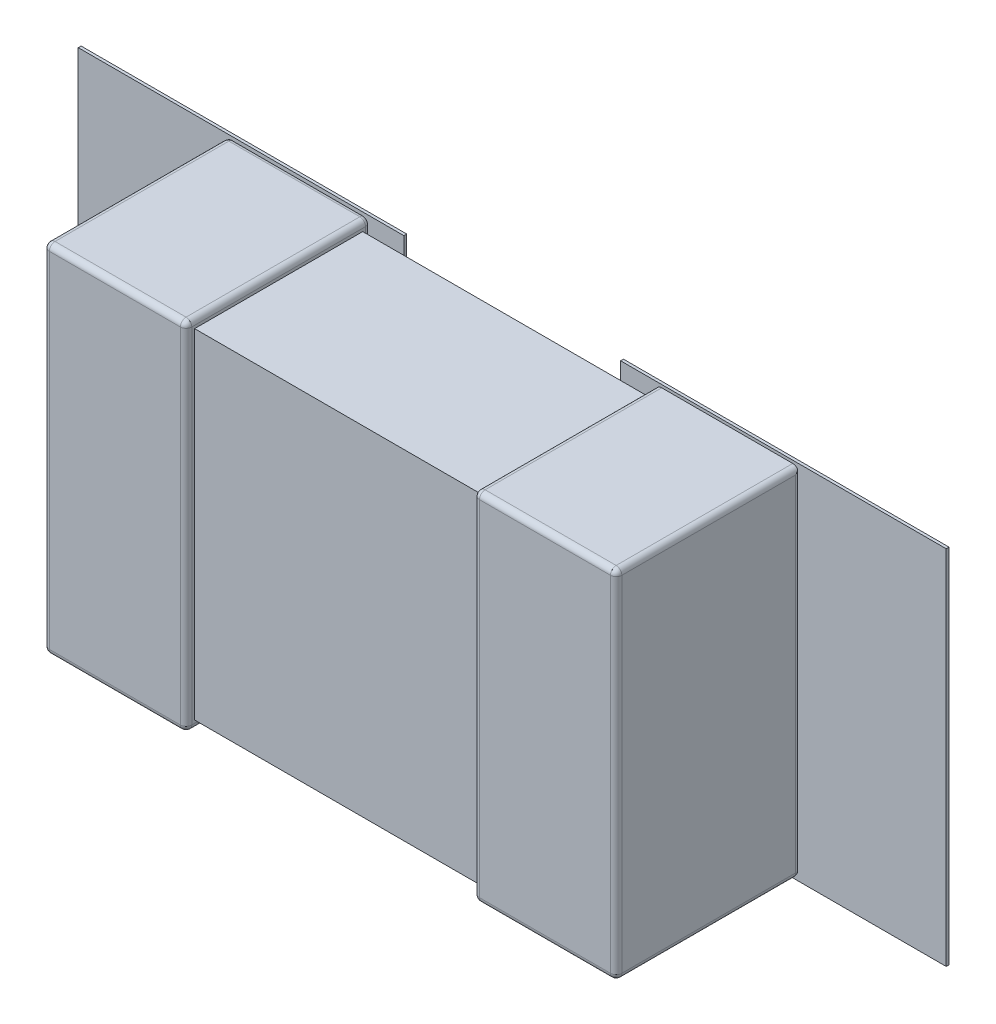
ISO-10303-21;
HEADER;
FILE_DESCRIPTION(('STEP AP214'),'2;1');
FILE_NAME('part.step','',(''),(''),'','','');
FILE_SCHEMA(('AUTOMOTIVE_DESIGN { 1 0 10303 214 1 1 1 1 }'));
ENDSEC;
DATA;
#1=APPLICATION_CONTEXT('core data for automotive mechanical design processes');
#2=APPLICATION_PROTOCOL_DEFINITION('international standard','automotive_design',2000,#1);
#3=PRODUCT_CONTEXT('',#1,'mechanical');
#4=PRODUCT('Part','Part','',(#3));
#5=PRODUCT_RELATED_PRODUCT_CATEGORY('part','',(#4));
#6=PRODUCT_DEFINITION_FORMATION('','',#4);
#7=PRODUCT_DEFINITION_CONTEXT('part definition',#1,'design');
#8=PRODUCT_DEFINITION('design','',#6,#7);
#9=PRODUCT_DEFINITION_SHAPE('','',#8);
#10=(LENGTH_UNIT() NAMED_UNIT(*) SI_UNIT(.MILLI.,.METRE.));
#11=(NAMED_UNIT(*) PLANE_ANGLE_UNIT() SI_UNIT($,.RADIAN.));
#12=(NAMED_UNIT(*) SI_UNIT($,.STERADIAN.) SOLID_ANGLE_UNIT());
#13=UNCERTAINTY_MEASURE_WITH_UNIT(LENGTH_MEASURE(1.E-05),#10,'distance_accuracy_value','');
#14=(GEOMETRIC_REPRESENTATION_CONTEXT(3) GLOBAL_UNCERTAINTY_ASSIGNED_CONTEXT((#13)) GLOBAL_UNIT_ASSIGNED_CONTEXT((#10,
#11,#12)) REPRESENTATION_CONTEXT('',''));
#15=CARTESIAN_POINT('',(0.,0.,0.));
#16=DIRECTION('',(0.,0.,1.));
#17=DIRECTION('',(1.,0.,0.));
#18=AXIS2_PLACEMENT_3D('',#15,#16,#17);
#19=CARTESIAN_POINT('',(0.98495100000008,-0.60496700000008,0.70618600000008));
#20=DIRECTION('',(0.707106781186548,0.,0.707106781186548));
#21=DIRECTION('',(0.,-1.,0.));
#22=AXIS2_PLACEMENT_3D('',#19,#20,#21);
#23=SPHERICAL_SURFACE('',#22,0.0199999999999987);
#24=CARTESIAN_POINT('',(0.98495100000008,-0.60496700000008,0.70618600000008));
#25=DIRECTION('',(1.,0.,0.));
#26=DIRECTION('',(0.,0.,-1.));
#27=AXIS2_PLACEMENT_3D('',#24,#25,#26);
#28=CIRCLE('',#27,0.0199999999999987);
#29=CARTESIAN_POINT('',(0.98495100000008,-0.624967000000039,0.70618600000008));
#30=VERTEX_POINT('',#29);
#31=CARTESIAN_POINT('',(0.98495100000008,-0.60496700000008,0.726186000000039));
#32=VERTEX_POINT('',#31);
#33=EDGE_CURVE('E392',#30,#32,#28,.F.);
#34=ORIENTED_EDGE('',*,*,#33,.F.);
#35=CARTESIAN_POINT('',(0.98495100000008,-0.60496700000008,0.70618600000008));
#36=DIRECTION('',(0.,0.,-1.));
#37=DIRECTION('',(-1.,0.,0.));
#38=AXIS2_PLACEMENT_3D('',#35,#36,#37);
#39=CIRCLE('',#38,0.0199999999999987);
#40=CARTESIAN_POINT('',(1.00495100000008,-0.60496700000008,0.70618600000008));
#41=VERTEX_POINT('',#40);
#42=EDGE_CURVE('E94',#41,#30,#39,.T.);
#43=ORIENTED_EDGE('',*,*,#42,.F.);
#44=CARTESIAN_POINT('',(0.98495100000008,-0.60496700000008,0.70618600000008));
#45=DIRECTION('',(0.,1.,0.));
#46=DIRECTION('',(0.,0.,1.));
#47=AXIS2_PLACEMENT_3D('',#44,#45,#46);
#48=CIRCLE('',#47,0.0199999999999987);
#49=CARTESIAN_POINT('',(0.99909313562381,-0.60496700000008,0.72032813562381));
#50=VERTEX_POINT('',#49);
#51=EDGE_CURVE('E54',#50,#41,#48,.T.);
#52=ORIENTED_EDGE('',*,*,#51,.F.);
#53=CARTESIAN_POINT('',(0.98495100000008,-0.60496700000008,0.70618600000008));
#54=DIRECTION('',(0.,1.,0.));
#55=DIRECTION('',(0.,0.,1.));
#56=AXIS2_PLACEMENT_3D('',#53,#54,#55);
#57=CIRCLE('',#56,0.0199999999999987);
#58=EDGE_CURVE('E35',#32,#50,#57,.T.);
#59=ORIENTED_EDGE('',*,*,#58,.F.);
#60=EDGE_LOOP('',(#34,#43,#52,#59));
#61=FACE_BOUND('',#60,.T.);
#62=ADVANCED_FACE('F16',(#61),#23,.T.);
#63=CARTESIAN_POINT('',(0.,0.,0.0762));
#64=DIRECTION('',(0.,0.,1.));
#65=DIRECTION('',(1.,0.,0.));
#66=AXIS2_PLACEMENT_3D('',#63,#64,#65);
#67=PLANE('',#66);
#68=DIRECTION('',(0.,1.,0.));
#69=VECTOR('',#68,1.);
#70=CARTESIAN_POINT('',(0.380500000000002,0.635,0.0762));
#71=LINE('',#70,#69);
#72=CARTESIAN_POINT('',(0.380500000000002,0.635,0.0762));
#73=VERTEX_POINT('',#72);
#74=CARTESIAN_POINT('',(0.380500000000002,-0.635,0.0762));
#75=VERTEX_POINT('',#74);
#76=EDGE_CURVE('E383',#73,#75,#71,.F.);
#77=ORIENTED_EDGE('',*,*,#76,.F.);
#78=DIRECTION('',(1.,0.,0.));
#79=VECTOR('',#78,1.);
#80=CARTESIAN_POINT('',(1.5235,0.635,0.0762));
#81=LINE('',#80,#79);
#82=CARTESIAN_POINT('',(1.5235,0.635,0.0762));
#83=VERTEX_POINT('',#82);
#84=EDGE_CURVE('E389',#83,#73,#81,.F.);
#85=ORIENTED_EDGE('',*,*,#84,.F.);
#86=DIRECTION('',(0.,1.,0.));
#87=VECTOR('',#86,1.);
#88=CARTESIAN_POINT('',(1.5235,-0.635,0.0762));
#89=LINE('',#88,#87);
#90=CARTESIAN_POINT('',(1.5235,-0.635,0.0762));
#91=VERTEX_POINT('',#90);
#92=EDGE_CURVE('E82',#91,#83,#89,.T.);
#93=ORIENTED_EDGE('',*,*,#92,.F.);
#94=DIRECTION('',(1.,0.,0.));
#95=VECTOR('',#94,1.);
#96=CARTESIAN_POINT('',(0.380500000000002,-0.635,0.0762));
#97=LINE('',#96,#95);
#98=EDGE_CURVE('E377',#75,#91,#97,.T.);
#99=ORIENTED_EDGE('',*,*,#98,.F.);
#100=EDGE_LOOP('',(#77,#85,#93,#99));
#101=FACE_BOUND('',#100,.T.);
#102=ADVANCED_FACE('F103',(#101),#67,.F.);
#103=CARTESIAN_POINT('',(0.98495100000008,0.60496700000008,0.70618600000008));
#104=DIRECTION('',(0.,0.707106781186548,0.707106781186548));
#105=DIRECTION('',(1.,0.,0.));
#106=AXIS2_PLACEMENT_3D('',#103,#104,#105);
#107=SPHERICAL_SURFACE('',#106,0.0199999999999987);
#108=CARTESIAN_POINT('',(0.98495100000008,0.60496700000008,0.70618600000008));
#109=DIRECTION('',(-1.,0.,0.));
#110=DIRECTION('',(0.,0.,1.));
#111=AXIS2_PLACEMENT_3D('',#108,#109,#110);
#112=CIRCLE('',#111,0.0199999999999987);
#113=CARTESIAN_POINT('',(0.98495100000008,0.61910913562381,0.72032813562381));
#114=VERTEX_POINT('',#113);
#115=CARTESIAN_POINT('',(0.98495100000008,0.624967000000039,0.70618600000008));
#116=VERTEX_POINT('',#115);
#117=EDGE_CURVE('E95',#114,#116,#112,.T.);
#118=ORIENTED_EDGE('',*,*,#117,.F.);
#119=CARTESIAN_POINT('',(0.98495100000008,0.60496700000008,0.70618600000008));
#120=DIRECTION('',(-1.,0.,0.));
#121=DIRECTION('',(0.,0.,1.));
#122=AXIS2_PLACEMENT_3D('',#119,#120,#121);
#123=CIRCLE('',#122,0.0199999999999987);
#124=CARTESIAN_POINT('',(0.98495100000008,0.60496700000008,0.726186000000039));
#125=VERTEX_POINT('',#124);
#126=EDGE_CURVE('E58',#125,#114,#123,.T.);
#127=ORIENTED_EDGE('',*,*,#126,.F.);
#128=CARTESIAN_POINT('',(0.98495100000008,0.60496700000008,0.70618600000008));
#129=DIRECTION('',(0.,1.,0.));
#130=DIRECTION('',(0.,0.,1.));
#131=AXIS2_PLACEMENT_3D('',#128,#129,#130);
#132=CIRCLE('',#131,0.0199999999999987);
#133=CARTESIAN_POINT('',(1.00495100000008,0.60496700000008,0.70618600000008));
#134=VERTEX_POINT('',#133);
#135=EDGE_CURVE('E20',#134,#125,#132,.F.);
#136=ORIENTED_EDGE('',*,*,#135,.F.);
#137=CARTESIAN_POINT('',(0.98495100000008,0.60496700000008,0.70618600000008));
#138=DIRECTION('',(0.,0.,-1.));
#139=DIRECTION('',(-1.,0.,0.));
#140=AXIS2_PLACEMENT_3D('',#137,#138,#139);
#141=CIRCLE('',#140,0.0199999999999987);
#142=EDGE_CURVE('E72',#116,#134,#141,.T.);
#143=ORIENTED_EDGE('',*,*,#142,.F.);
#144=EDGE_LOOP('',(#118,#127,#136,#143));
#145=FACE_BOUND('',#144,.T.);
#146=ADVANCED_FACE('F84',(#145),#107,.T.);
#147=CARTESIAN_POINT('',(1.004951,-0.624967,0.0762));
#148=DIRECTION('',(1.,0.,0.));
#149=DIRECTION('',(0.,0.,-1.));
#150=AXIS2_PLACEMENT_3D('',#147,#148,#149);
#151=PLANE('',#150);
#152=DIRECTION('',(0.,-1.,0.));
#153=VECTOR('',#152,1.);
#154=CARTESIAN_POINT('',(1.00495100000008,2.43846719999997,0.0961999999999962));
#155=LINE('',#154,#153);
#156=CARTESIAN_POINT('',(1.00495100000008,0.60496700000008,0.0961999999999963));
#157=VERTEX_POINT('',#156);
#158=CARTESIAN_POINT('',(1.00495100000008,-0.60496700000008,0.0961999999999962));
#159=VERTEX_POINT('',#158);
#160=EDGE_CURVE('E67',#157,#159,#155,.T.);
#161=ORIENTED_EDGE('',*,*,#160,.F.);
#162=DIRECTION('',(0.,0.,-1.));
#163=VECTOR('',#162,1.);
#164=CARTESIAN_POINT('',(1.00495100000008,0.60496700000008,1.5735077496));
#165=LINE('',#164,#163);
#166=EDGE_CURVE('E62',#134,#157,#165,.T.);
#167=ORIENTED_EDGE('',*,*,#166,.F.);
#168=DIRECTION('',(0.,1.,0.));
#169=VECTOR('',#168,1.);
#170=CARTESIAN_POINT('',(1.00495100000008,-2.43846719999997,0.70618600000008));
#171=LINE('',#170,#169);
#172=EDGE_CURVE('E49',#41,#134,#171,.T.);
#173=ORIENTED_EDGE('',*,*,#172,.F.);
#174=DIRECTION('',(0.,0.,-1.));
#175=VECTOR('',#174,1.);
#176=CARTESIAN_POINT('',(1.00495100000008,-0.60496700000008,1.5735077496));
#177=LINE('',#176,#175);
#178=EDGE_CURVE('E91',#159,#41,#177,.F.);
#179=ORIENTED_EDGE('',*,*,#178,.F.);
#180=EDGE_LOOP('',(#161,#167,#173,#179));
#181=FACE_BOUND('',#180,.T.);
#182=ADVANCED_FACE('F64',(#181),#151,.T.);
#183=CARTESIAN_POINT('',(0.98495100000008,-2.43846719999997,0.70618600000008));
#184=DIRECTION('',(0.,1.,0.));
#185=DIRECTION('',(0.,0.,1.));
#186=AXIS2_PLACEMENT_3D('',#183,#184,#185);
#187=CYLINDRICAL_SURFACE('',#186,0.0199999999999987);
#188=ORIENTED_EDGE('',*,*,#51,.T.);
#189=ORIENTED_EDGE('',*,*,#172,.T.);
#190=ORIENTED_EDGE('',*,*,#135,.T.);
#191=DIRECTION('',(0.,1.,0.));
#192=VECTOR('',#191,1.);
#193=CARTESIAN_POINT('',(0.98495100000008,0.,0.726186));
#194=LINE('',#193,#192);
#195=EDGE_CURVE('E89',#32,#125,#194,.T.);
#196=ORIENTED_EDGE('',*,*,#195,.F.);
#197=ORIENTED_EDGE('',*,*,#58,.T.);
#198=EDGE_LOOP('',(#188,#189,#190,#196,#197));
#199=FACE_BOUND('',#198,.T.);
#200=ADVANCED_FACE('F51',(#199),#187,.T.);
#201=CARTESIAN_POINT('',(5.4955692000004,0.60496700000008,0.70618600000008));
#202=DIRECTION('',(-1.,0.,0.));
#203=DIRECTION('',(0.,0.,1.));
#204=AXIS2_PLACEMENT_3D('',#201,#202,#203);
#205=CYLINDRICAL_SURFACE('',#204,0.0199999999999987);
#206=ORIENTED_EDGE('',*,*,#117,.T.);
#207=DIRECTION('',(1.,0.,0.));
#208=VECTOR('',#207,1.);
#209=CARTESIAN_POINT('',(1.004951,0.624967,0.70618600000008));
#210=LINE('',#209,#208);
#211=CARTESIAN_POINT('',(0.524950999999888,0.624967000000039,0.70618600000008));
#212=VERTEX_POINT('',#211);
#213=EDGE_CURVE('E415',#212,#116,#210,.T.);
#214=ORIENTED_EDGE('',*,*,#213,.F.);
#215=CARTESIAN_POINT('',(0.524950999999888,0.60496700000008,0.70618600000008));
#216=DIRECTION('',(-1.,0.,0.));
#217=DIRECTION('',(0.,0.,1.));
#218=AXIS2_PLACEMENT_3D('',#215,#216,#217);
#219=CIRCLE('',#218,0.0199999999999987);
#220=CARTESIAN_POINT('',(0.524950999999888,0.60496700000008,0.726186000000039));
#221=VERTEX_POINT('',#220);
#222=EDGE_CURVE('E416',#221,#212,#219,.T.);
#223=ORIENTED_EDGE('',*,*,#222,.F.);
#224=DIRECTION('',(1.,0.,0.));
#225=VECTOR('',#224,1.);
#226=CARTESIAN_POINT('',(0.,0.60496700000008,0.726186));
#227=LINE('',#226,#225);
#228=EDGE_CURVE('E420',#125,#221,#227,.F.);
#229=ORIENTED_EDGE('',*,*,#228,.F.);
#230=ORIENTED_EDGE('',*,*,#126,.T.);
#231=EDGE_LOOP('',(#206,#214,#223,#229,#230));
#232=FACE_BOUND('',#231,.T.);
#233=ADVANCED_FACE('F590',(#232),#205,.T.);
#234=CARTESIAN_POINT('',(0.98495100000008,-0.60496700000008,1.5735077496));
#235=DIRECTION('',(0.,0.,-1.));
#236=DIRECTION('',(-1.,0.,0.));
#237=AXIS2_PLACEMENT_3D('',#234,#235,#236);
#238=CYLINDRICAL_SURFACE('',#237,0.0199999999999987);
#239=ORIENTED_EDGE('',*,*,#42,.T.);
#240=DIRECTION('',(0.,0.,-1.));
#241=VECTOR('',#240,1.);
#242=CARTESIAN_POINT('',(0.98495100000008,-0.624967,0.0762));
#243=LINE('',#242,#241);
#244=CARTESIAN_POINT('',(0.98495100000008,-0.624967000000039,0.096199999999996));
#245=VERTEX_POINT('',#244);
#246=EDGE_CURVE('E393',#245,#30,#243,.F.);
#247=ORIENTED_EDGE('',*,*,#246,.F.);
#248=CARTESIAN_POINT('',(0.98495100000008,-0.60496700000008,0.0961999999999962));
#249=DIRECTION('',(0.,0.,-1.));
#250=DIRECTION('',(0.707106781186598,-0.707106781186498,0.));
#251=AXIS2_PLACEMENT_3D('',#248,#249,#250);
#252=CIRCLE('',#251,0.0199999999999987);
#253=CARTESIAN_POINT('',(0.999093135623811,-0.619109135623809,0.0961999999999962));
#254=VERTEX_POINT('',#253);
#255=EDGE_CURVE('E364',#254,#245,#252,.T.);
#256=ORIENTED_EDGE('',*,*,#255,.F.);
#257=CARTESIAN_POINT('',(0.98495100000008,-0.60496700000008,0.0961999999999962));
#258=DIRECTION('',(0.,0.,-1.));
#259=DIRECTION('',(-1.,0.,0.));
#260=AXIS2_PLACEMENT_3D('',#257,#258,#259);
#261=CIRCLE('',#260,0.0199999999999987);
#262=EDGE_CURVE('E368',#159,#254,#261,.T.);
#263=ORIENTED_EDGE('',*,*,#262,.F.);
#264=ORIENTED_EDGE('',*,*,#178,.T.);
#265=EDGE_LOOP('',(#239,#247,#256,#263,#264));
#266=FACE_BOUND('',#265,.T.);
#267=ADVANCED_FACE('F638',(#266),#238,.T.);
#268=CARTESIAN_POINT('',(-5.4955692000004,-0.60496700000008,0.70618600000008));
#269=DIRECTION('',(1.,0.,0.));
#270=DIRECTION('',(0.,0.,-1.));
#271=AXIS2_PLACEMENT_3D('',#268,#269,#270);
#272=CYLINDRICAL_SURFACE('',#271,0.0199999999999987);
#273=ORIENTED_EDGE('',*,*,#33,.T.);
#274=DIRECTION('',(1.,0.,0.));
#275=VECTOR('',#274,1.);
#276=CARTESIAN_POINT('',(0.,-0.60496700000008,0.726186));
#277=LINE('',#276,#275);
#278=CARTESIAN_POINT('',(0.524950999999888,-0.60496700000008,0.726186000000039));
#279=VERTEX_POINT('',#278);
#280=EDGE_CURVE('E491',#279,#32,#277,.T.);
#281=ORIENTED_EDGE('',*,*,#280,.F.);
#282=CARTESIAN_POINT('',(0.524950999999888,-0.60496700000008,0.70618600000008));
#283=DIRECTION('',(1.,0.,0.));
#284=DIRECTION('',(0.,0.,-1.));
#285=AXIS2_PLACEMENT_3D('',#282,#283,#284);
#286=CIRCLE('',#285,0.0199999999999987);
#287=CARTESIAN_POINT('',(0.524950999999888,-0.624967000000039,0.70618600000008));
#288=VERTEX_POINT('',#287);
#289=EDGE_CURVE('E395',#288,#279,#286,.F.);
#290=ORIENTED_EDGE('',*,*,#289,.F.);
#291=DIRECTION('',(1.,0.,0.));
#292=VECTOR('',#291,1.);
#293=CARTESIAN_POINT('',(-1.004951,-0.624967,0.70618600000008));
#294=LINE('',#293,#292);
#295=EDGE_CURVE('E419',#30,#288,#294,.F.);
#296=ORIENTED_EDGE('',*,*,#295,.F.);
#297=EDGE_LOOP('',(#273,#281,#290,#296));
#298=FACE_BOUND('',#297,.T.);
#299=ADVANCED_FACE('F647',(#298),#272,.T.);
#300=CARTESIAN_POINT('',(1.5235,0.635,0.0762));
#301=DIRECTION('',(0.,1.,0.));
#302=DIRECTION('',(0.,0.,1.));
#303=AXIS2_PLACEMENT_3D('',#300,#301,#302);
#304=PLANE('',#303);
#305=DIRECTION('',(0.,0.,-1.));
#306=VECTOR('',#305,1.);
#307=CARTESIAN_POINT('',(1.5235,0.635,0.0762));
#308=LINE('',#307,#306);
#309=CARTESIAN_POINT('',(1.5235,0.635,0.0862000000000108));
#310=VERTEX_POINT('',#309);
#311=EDGE_CURVE('E374',#83,#310,#308,.F.);
#312=ORIENTED_EDGE('',*,*,#311,.F.);
#313=ORIENTED_EDGE('',*,*,#84,.T.);
#314=DIRECTION('',(0.,0.,1.));
#315=VECTOR('',#314,1.);
#316=CARTESIAN_POINT('',(0.380500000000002,0.635,0.0762));
#317=LINE('',#316,#315);
#318=CARTESIAN_POINT('',(0.380500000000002,0.635,0.0862000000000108));
#319=VERTEX_POINT('',#318);
#320=EDGE_CURVE('E386',#319,#73,#317,.F.);
#321=ORIENTED_EDGE('',*,*,#320,.F.);
#322=DIRECTION('',(1.,0.,0.));
#323=VECTOR('',#322,1.);
#324=CARTESIAN_POINT('',(0.,0.635,0.0862000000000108));
#325=LINE('',#324,#323);
#326=EDGE_CURVE('E424',#310,#319,#325,.F.);
#327=ORIENTED_EDGE('',*,*,#326,.F.);
#328=EDGE_LOOP('',(#312,#313,#321,#327));
#329=FACE_BOUND('',#328,.T.);
#330=ADVANCED_FACE('F1408',(#329),#304,.T.);
#331=CARTESIAN_POINT('',(0.380500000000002,0.635,0.0762));
#332=DIRECTION('',(-1.,0.,0.));
#333=DIRECTION('',(0.,0.,1.));
#334=AXIS2_PLACEMENT_3D('',#331,#332,#333);
#335=PLANE('',#334);
#336=ORIENTED_EDGE('',*,*,#320,.T.);
#337=ORIENTED_EDGE('',*,*,#76,.T.);
#338=DIRECTION('',(0.,0.,-1.));
#339=VECTOR('',#338,1.);
#340=CARTESIAN_POINT('',(0.380500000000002,-0.635,0.0762));
#341=LINE('',#340,#339);
#342=CARTESIAN_POINT('',(0.380500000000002,-0.635,0.0862000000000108));
#343=VERTEX_POINT('',#342);
#344=EDGE_CURVE('E380',#343,#75,#341,.T.);
#345=ORIENTED_EDGE('',*,*,#344,.F.);
#346=DIRECTION('',(0.,1.,0.));
#347=VECTOR('',#346,1.);
#348=CARTESIAN_POINT('',(0.380500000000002,0.,0.0862000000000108));
#349=LINE('',#348,#347);
#350=EDGE_CURVE('E432',#319,#343,#349,.F.);
#351=ORIENTED_EDGE('',*,*,#350,.F.);
#352=EDGE_LOOP('',(#336,#337,#345,#351));
#353=FACE_BOUND('',#352,.T.);
#354=ADVANCED_FACE('F1503',(#353),#335,.T.);
#355=CARTESIAN_POINT('',(0.380500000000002,-0.635,0.0762));
#356=DIRECTION('',(0.,-1.,0.));
#357=DIRECTION('',(0.,0.,-1.));
#358=AXIS2_PLACEMENT_3D('',#355,#356,#357);
#359=PLANE('',#358);
#360=ORIENTED_EDGE('',*,*,#344,.T.);
#361=ORIENTED_EDGE('',*,*,#98,.T.);
#362=DIRECTION('',(0.,0.,-1.));
#363=VECTOR('',#362,1.);
#364=CARTESIAN_POINT('',(1.5235,-0.635,0.0762));
#365=LINE('',#364,#363);
#366=CARTESIAN_POINT('',(1.5235,-0.635,0.0862000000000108));
#367=VERTEX_POINT('',#366);
#368=EDGE_CURVE('E371',#367,#91,#365,.T.);
#369=ORIENTED_EDGE('',*,*,#368,.F.);
#370=DIRECTION('',(1.,0.,0.));
#371=VECTOR('',#370,1.);
#372=CARTESIAN_POINT('',(0.,-0.635,0.0862000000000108));
#373=LINE('',#372,#371);
#374=EDGE_CURVE('E440',#343,#367,#373,.T.);
#375=ORIENTED_EDGE('',*,*,#374,.F.);
#376=EDGE_LOOP('',(#360,#361,#369,#375));
#377=FACE_BOUND('',#376,.T.);
#378=ADVANCED_FACE('F1496',(#377),#359,.T.);
#379=CARTESIAN_POINT('',(1.5235,-0.635,0.0762));
#380=DIRECTION('',(1.,0.,0.));
#381=DIRECTION('',(0.,0.,-1.));
#382=AXIS2_PLACEMENT_3D('',#379,#380,#381);
#383=PLANE('',#382);
#384=ORIENTED_EDGE('',*,*,#368,.T.);
#385=ORIENTED_EDGE('',*,*,#92,.T.);
#386=ORIENTED_EDGE('',*,*,#311,.T.);
#387=DIRECTION('',(0.,1.,0.));
#388=VECTOR('',#387,1.);
#389=CARTESIAN_POINT('',(1.5235,0.,0.0862000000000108));
#390=LINE('',#389,#388);
#391=EDGE_CURVE('E518',#367,#310,#390,.T.);
#392=ORIENTED_EDGE('',*,*,#391,.F.);
#393=EDGE_LOOP('',(#384,#385,#386,#392));
#394=FACE_BOUND('',#393,.T.);
#395=ADVANCED_FACE('F1397',(#394),#383,.T.);
#396=CARTESIAN_POINT('',(0.98495100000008,0.60496700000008,1.5735077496));
#397=DIRECTION('',(0.,0.,-1.));
#398=DIRECTION('',(-1.,0.,0.));
#399=AXIS2_PLACEMENT_3D('',#396,#397,#398);
#400=CYLINDRICAL_SURFACE('',#399,0.0199999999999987);
#401=CARTESIAN_POINT('',(0.98495100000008,0.60496700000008,0.0961999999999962));
#402=DIRECTION('',(0.,-0.707106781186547,-0.707106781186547));
#403=DIRECTION('',(0.,-0.707106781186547,0.707106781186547));
#404=AXIS2_PLACEMENT_3D('',#401,#402,#403);
#405=ELLIPSE('',#404,0.0282842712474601,0.0199999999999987);
#406=CARTESIAN_POINT('',(1.00227150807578,0.614967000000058,0.0862000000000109));
#407=VERTEX_POINT('',#406);
#408=EDGE_CURVE('E71',#407,#157,#405,.T.);
#409=ORIENTED_EDGE('',*,*,#408,.F.);
#410=CARTESIAN_POINT('',(0.98495100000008,0.60496700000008,0.0862000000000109));
#411=DIRECTION('',(0.,0.,-1.));
#412=DIRECTION('',(-1.,0.,0.));
#413=AXIS2_PLACEMENT_3D('',#410,#411,#412);
#414=CIRCLE('',#413,0.0199999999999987);
#415=CARTESIAN_POINT('',(0.98495100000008,0.624967,0.0862000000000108));
#416=VERTEX_POINT('',#415);
#417=EDGE_CURVE('E347',#416,#407,#414,.T.);
#418=ORIENTED_EDGE('',*,*,#417,.F.);
#419=DIRECTION('',(0.,0.,1.));
#420=VECTOR('',#419,1.);
#421=CARTESIAN_POINT('',(0.98495100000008,0.624967,0.0762));
#422=LINE('',#421,#420);
#423=EDGE_CURVE('E79',#116,#416,#422,.F.);
#424=ORIENTED_EDGE('',*,*,#423,.F.);
#425=ORIENTED_EDGE('',*,*,#142,.T.);
#426=ORIENTED_EDGE('',*,*,#166,.T.);
#427=EDGE_LOOP('',(#409,#418,#424,#425,#426));
#428=FACE_BOUND('',#427,.T.);
#429=ADVANCED_FACE('F76',(#428),#400,.T.);
#430=CARTESIAN_POINT('',(0.98495100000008,2.43846719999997,0.0961999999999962));
#431=DIRECTION('',(0.,-1.,0.));
#432=DIRECTION('',(0.,0.,-1.));
#433=AXIS2_PLACEMENT_3D('',#430,#431,#432);
#434=CYLINDRICAL_SURFACE('',#433,0.0199999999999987);
#435=CARTESIAN_POINT('',(0.98495100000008,-0.60496700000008,0.0961999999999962));
#436=DIRECTION('',(0.,-1.,0.));
#437=DIRECTION('',(0.,0.,-1.));
#438=AXIS2_PLACEMENT_3D('',#435,#436,#437);
#439=CIRCLE('',#438,0.0199999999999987);
#440=CARTESIAN_POINT('',(1.00227150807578,-0.60496700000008,0.0862000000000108));
#441=VERTEX_POINT('',#440);
#442=EDGE_CURVE('E96',#441,#159,#439,.T.);
#443=ORIENTED_EDGE('',*,*,#442,.F.);
#444=DIRECTION('',(0.,1.,0.));
#445=VECTOR('',#444,1.);
#446=CARTESIAN_POINT('',(1.00227150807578,0.,0.0862000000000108));
#447=LINE('',#446,#445);
#448=EDGE_CURVE('E346',#407,#441,#447,.F.);
#449=ORIENTED_EDGE('',*,*,#448,.F.);
#450=ORIENTED_EDGE('',*,*,#408,.T.);
#451=ORIENTED_EDGE('',*,*,#160,.T.);
#452=EDGE_LOOP('',(#443,#449,#450,#451));
#453=FACE_BOUND('',#452,.T.);
#454=ADVANCED_FACE('F356',(#453),#434,.T.);
#455=CARTESIAN_POINT('',(0.98495100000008,-0.60496700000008,0.0961999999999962));
#456=DIRECTION('',(0.707106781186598,-0.707106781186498,0.));
#457=DIRECTION('',(0.,0.,-1.));
#458=AXIS2_PLACEMENT_3D('',#455,#456,#457);
#459=SPHERICAL_SURFACE('',#458,0.0199999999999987);
#460=CARTESIAN_POINT('',(0.98495100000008,-0.60496700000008,0.0961999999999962));
#461=DIRECTION('',(-1.,0.,0.));
#462=DIRECTION('',(0.,0.,1.));
#463=AXIS2_PLACEMENT_3D('',#460,#461,#462);
#464=CIRCLE('',#463,0.0199999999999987);
#465=CARTESIAN_POINT('',(0.98495100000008,-0.62228750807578,0.0862000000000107));
#466=VERTEX_POINT('',#465);
#467=EDGE_CURVE('E367',#466,#245,#464,.T.);
#468=ORIENTED_EDGE('',*,*,#467,.F.);
#469=CARTESIAN_POINT('',(1.00227150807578,-0.60496700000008,0.0862000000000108));
#470=CARTESIAN_POINT('',(1.00228438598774,-0.60691927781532,0.0862000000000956));
#471=CARTESIAN_POINT('',(1.00194331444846,-0.608863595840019,0.0862000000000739));
#472=CARTESIAN_POINT('',(1.00064694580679,-0.612536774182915,0.0862000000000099));
#473=CARTESIAN_POINT('',(0.999691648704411,-0.614265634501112,0.0861999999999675));
#474=CARTESIAN_POINT('',(0.99726050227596,-0.617308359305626,0.0862000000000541));
#475=CARTESIAN_POINT('',(0.995784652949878,-0.618622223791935,0.086200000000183));
#476=CARTESIAN_POINT('',(0.992479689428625,-0.620685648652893,0.0862000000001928));
#477=CARTESIAN_POINT('',(0.990650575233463,-0.621435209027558,0.0862000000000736));
#478=CARTESIAN_POINT('',(0.987505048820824,-0.622147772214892,0.0861999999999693));
#479=CARTESIAN_POINT('',(0.986227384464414,-0.622292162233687,0.0861999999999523));
#480=CARTESIAN_POINT('',(0.98495100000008,-0.622287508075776,0.0862000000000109));
#481=B_SPLINE_CURVE_WITH_KNOTS('',3,(#469,#470,#471,#472,#473,#474,#475,#476,#477,#478,#479,
#480),.UNSPECIFIED.,.F.,.F.,(4,2,2,2,2,4),(0.,0.00581573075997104,0.0116314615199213,
0.0174471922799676,0.0232629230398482,0.0270884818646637),.UNSPECIFIED.);
#482=EDGE_CURVE('E338',#441,#466,#481,.T.);
#483=ORIENTED_EDGE('',*,*,#482,.F.);
#484=ORIENTED_EDGE('',*,*,#442,.T.);
#485=ORIENTED_EDGE('',*,*,#262,.T.);
#486=ORIENTED_EDGE('',*,*,#255,.T.);
#487=EDGE_LOOP('',(#468,#483,#484,#485,#486));
#488=FACE_BOUND('',#487,.T.);
#489=ADVANCED_FACE('F349',(#488),#459,.T.);
#490=CARTESIAN_POINT('',(5.4955692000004,-0.60496700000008,0.0961999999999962));
#491=DIRECTION('',(-1.,0.,0.));
#492=DIRECTION('',(0.,0.,1.));
#493=AXIS2_PLACEMENT_3D('',#490,#491,#492);
#494=CYLINDRICAL_SURFACE('',#493,0.0199999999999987);
#495=CARTESIAN_POINT('',(0.524950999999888,-0.60496700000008,0.0961999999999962));
#496=DIRECTION('',(-1.,0.,0.));
#497=DIRECTION('',(0.,0.,1.));
#498=AXIS2_PLACEMENT_3D('',#495,#496,#497);
#499=CIRCLE('',#498,0.0199999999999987);
#500=CARTESIAN_POINT('',(0.524950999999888,-0.62228750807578,0.0862000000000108));
#501=VERTEX_POINT('',#500);
#502=CARTESIAN_POINT('',(0.524950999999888,-0.624967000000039,0.0961999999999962));
#503=VERTEX_POINT('',#502);
#504=EDGE_CURVE('E422',#501,#503,#499,.T.);
#505=ORIENTED_EDGE('',*,*,#504,.F.);
#506=DIRECTION('',(1.,0.,0.));
#507=VECTOR('',#506,1.);
#508=CARTESIAN_POINT('',(0.,-0.622287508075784,0.0862000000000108));
#509=LINE('',#508,#507);
#510=EDGE_CURVE('E345',#466,#501,#509,.F.);
#511=ORIENTED_EDGE('',*,*,#510,.F.);
#512=ORIENTED_EDGE('',*,*,#467,.T.);
#513=DIRECTION('',(1.,0.,0.));
#514=VECTOR('',#513,1.);
#515=CARTESIAN_POINT('',(-1.004951,-0.624967,0.0961999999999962));
#516=LINE('',#515,#514);
#517=EDGE_CURVE('E396',#503,#245,#516,.T.);
#518=ORIENTED_EDGE('',*,*,#517,.F.);
#519=EDGE_LOOP('',(#505,#511,#512,#518));
#520=FACE_BOUND('',#519,.T.);
#521=ADVANCED_FACE('F355',(#520),#494,.T.);
#522=CARTESIAN_POINT('',(1.004951,0.624967,0.0762));
#523=DIRECTION('',(0.,1.,0.));
#524=DIRECTION('',(0.,0.,1.));
#525=AXIS2_PLACEMENT_3D('',#522,#523,#524);
#526=PLANE('',#525);
#527=ORIENTED_EDGE('',*,*,#423,.T.);
#528=DIRECTION('',(1.,0.,0.));
#529=VECTOR('',#528,1.);
#530=CARTESIAN_POINT('',(0.,0.624967,0.0862000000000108));
#531=LINE('',#530,#529);
#532=CARTESIAN_POINT('',(0.524950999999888,0.624967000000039,0.0862000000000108));
#533=VERTEX_POINT('',#532);
#534=EDGE_CURVE('E507',#533,#416,#531,.T.);
#535=ORIENTED_EDGE('',*,*,#534,.F.);
#536=DIRECTION('',(0.,0.,1.));
#537=VECTOR('',#536,1.);
#538=CARTESIAN_POINT('',(0.524950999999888,0.624967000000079,-0.7711217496));
#539=LINE('',#538,#537);
#540=EDGE_CURVE('E496',#212,#533,#539,.F.);
#541=ORIENTED_EDGE('',*,*,#540,.F.);
#542=ORIENTED_EDGE('',*,*,#213,.T.);
#543=EDGE_LOOP('',(#527,#535,#541,#542));
#544=FACE_BOUND('',#543,.T.);
#545=ADVANCED_FACE('F505',(#544),#526,.T.);
#546=CARTESIAN_POINT('',(0.,0.,0.726186));
#547=DIRECTION('',(0.,0.,1.));
#548=DIRECTION('',(1.,0.,0.));
#549=AXIS2_PLACEMENT_3D('',#546,#547,#548);
#550=PLANE('',#549);
#551=ORIENTED_EDGE('',*,*,#195,.T.);
#552=ORIENTED_EDGE('',*,*,#228,.T.);
#553=DIRECTION('',(0.,-1.,0.));
#554=VECTOR('',#553,1.);
#555=CARTESIAN_POINT('',(0.524950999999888,2.43846719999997,0.726186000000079));
#556=LINE('',#555,#554);
#557=EDGE_CURVE('E489',#279,#221,#556,.F.);
#558=ORIENTED_EDGE('',*,*,#557,.F.);
#559=ORIENTED_EDGE('',*,*,#280,.T.);
#560=EDGE_LOOP('',(#551,#552,#558,#559));
#561=FACE_BOUND('',#560,.T.);
#562=ADVANCED_FACE('F484',(#561),#550,.T.);
#563=CARTESIAN_POINT('',(0.524950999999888,0.60496700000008,0.70618600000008));
#564=DIRECTION('',(-0.707106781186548,0.,0.707106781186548));
#565=DIRECTION('',(0.,1.,0.));
#566=AXIS2_PLACEMENT_3D('',#563,#564,#565);
#567=SPHERICAL_SURFACE('',#566,0.0199999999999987);
#568=ORIENTED_EDGE('',*,*,#222,.T.);
#569=CARTESIAN_POINT('',(0.524950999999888,0.60496700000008,0.70618600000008));
#570=DIRECTION('',(0.,0.,1.));
#571=DIRECTION('',(1.,0.,0.));
#572=AXIS2_PLACEMENT_3D('',#569,#570,#571);
#573=CIRCLE('',#572,0.0199999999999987);
#574=CARTESIAN_POINT('',(0.504950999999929,0.60496700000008,0.70618600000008));
#575=VERTEX_POINT('',#574);
#576=EDGE_CURVE('E499',#575,#212,#573,.F.);
#577=ORIENTED_EDGE('',*,*,#576,.F.);
#578=CARTESIAN_POINT('',(0.524950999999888,0.60496700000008,0.70618600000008));
#579=DIRECTION('',(0.,-1.,0.));
#580=DIRECTION('',(0.,0.,-1.));
#581=AXIS2_PLACEMENT_3D('',#578,#579,#580);
#582=CIRCLE('',#581,0.0199999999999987);
#583=CARTESIAN_POINT('',(0.510808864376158,0.60496700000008,0.72032813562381));
#584=VERTEX_POINT('',#583);
#585=EDGE_CURVE('E530',#584,#575,#582,.T.);
#586=ORIENTED_EDGE('',*,*,#585,.F.);
#587=CARTESIAN_POINT('',(0.524950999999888,0.60496700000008,0.70618600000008));
#588=DIRECTION('',(0.,-1.,0.));
#589=DIRECTION('',(0.,0.,-1.));
#590=AXIS2_PLACEMENT_3D('',#587,#588,#589);
#591=CIRCLE('',#590,0.0199999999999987);
#592=EDGE_CURVE('E527',#221,#584,#591,.T.);
#593=ORIENTED_EDGE('',*,*,#592,.F.);
#594=EDGE_LOOP('',(#568,#577,#586,#593));
#595=FACE_BOUND('',#594,.T.);
#596=ADVANCED_FACE('F479',(#595),#567,.T.);
#597=CARTESIAN_POINT('',(-1.004951,-0.624967,0.0762));
#598=DIRECTION('',(0.,-1.,0.));
#599=DIRECTION('',(0.,0.,-1.));
#600=AXIS2_PLACEMENT_3D('',#597,#598,#599);
#601=PLANE('',#600);
#602=ORIENTED_EDGE('',*,*,#517,.T.);
#603=ORIENTED_EDGE('',*,*,#246,.T.);
#604=ORIENTED_EDGE('',*,*,#295,.T.);
#605=DIRECTION('',(0.,0.,-1.));
#606=VECTOR('',#605,1.);
#607=CARTESIAN_POINT('',(0.524950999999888,-0.624967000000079,1.5735077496));
#608=LINE('',#607,#606);
#609=EDGE_CURVE('E464',#503,#288,#608,.F.);
#610=ORIENTED_EDGE('',*,*,#609,.F.);
#611=EDGE_LOOP('',(#602,#603,#604,#610));
#612=FACE_BOUND('',#611,.T.);
#613=ADVANCED_FACE('F475',(#612),#601,.T.);
#614=CARTESIAN_POINT('',(0.524950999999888,-0.60496700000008,0.70618600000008));
#615=DIRECTION('',(-0.707106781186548,-0.707106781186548,0.));
#616=DIRECTION('',(0.,0.,1.));
#617=AXIS2_PLACEMENT_3D('',#614,#615,#616);
#618=SPHERICAL_SURFACE('',#617,0.0199999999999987);
#619=ORIENTED_EDGE('',*,*,#289,.T.);
#620=CARTESIAN_POINT('',(0.524950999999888,-0.60496700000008,0.70618600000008));
#621=DIRECTION('',(0.,-1.,0.));
#622=DIRECTION('',(0.,0.,-1.));
#623=AXIS2_PLACEMENT_3D('',#620,#621,#622);
#624=CIRCLE('',#623,0.0199999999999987);
#625=CARTESIAN_POINT('',(0.504950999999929,-0.60496700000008,0.70618600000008));
#626=VERTEX_POINT('',#625);
#627=EDGE_CURVE('E468',#626,#279,#624,.F.);
#628=ORIENTED_EDGE('',*,*,#627,.F.);
#629=CARTESIAN_POINT('',(0.524950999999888,-0.60496700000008,0.70618600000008));
#630=DIRECTION('',(0.,0.,-1.));
#631=DIRECTION('',(-1.,0.,0.));
#632=AXIS2_PLACEMENT_3D('',#629,#630,#631);
#633=CIRCLE('',#632,0.0199999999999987);
#634=CARTESIAN_POINT('',(0.510808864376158,-0.61910913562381,0.70618600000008));
#635=VERTEX_POINT('',#634);
#636=EDGE_CURVE('E533',#635,#626,#633,.T.);
#637=ORIENTED_EDGE('',*,*,#636,.F.);
#638=CARTESIAN_POINT('',(0.524950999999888,-0.60496700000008,0.70618600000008));
#639=DIRECTION('',(0.,0.,-1.));
#640=DIRECTION('',(-1.,0.,0.));
#641=AXIS2_PLACEMENT_3D('',#638,#639,#640);
#642=CIRCLE('',#641,0.0199999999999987);
#643=EDGE_CURVE('E467',#288,#635,#642,.T.);
#644=ORIENTED_EDGE('',*,*,#643,.F.);
#645=EDGE_LOOP('',(#619,#628,#637,#644));
#646=FACE_BOUND('',#645,.T.);
#647=ADVANCED_FACE('F472',(#646),#618,.T.);
#648=CARTESIAN_POINT('',(0.524950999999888,-0.60496700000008,0.0961999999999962));
#649=DIRECTION('',(-0.707106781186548,0.,-0.707106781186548));
#650=DIRECTION('',(0.,-1.,0.));
#651=AXIS2_PLACEMENT_3D('',#648,#649,#650);
#652=SPHERICAL_SURFACE('',#651,0.0199999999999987);
#653=CARTESIAN_POINT('',(0.524950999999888,-0.60496700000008,0.0961999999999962));
#654=DIRECTION('',(0.,1.,0.));
#655=DIRECTION('',(0.,0.,1.));
#656=AXIS2_PLACEMENT_3D('',#653,#654,#655);
#657=CIRCLE('',#656,0.0199999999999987);
#658=CARTESIAN_POINT('',(0.507630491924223,-0.60496700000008,0.0861999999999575));
#659=VERTEX_POINT('',#658);
#660=CARTESIAN_POINT('',(0.504950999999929,-0.60496700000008,0.0961999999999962));
#661=VERTEX_POINT('',#660);
#662=EDGE_CURVE('E449',#659,#661,#657,.T.);
#663=ORIENTED_EDGE('',*,*,#662,.F.);
#664=CARTESIAN_POINT('',(0.524950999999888,-0.622287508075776,0.0862000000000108));
#665=CARTESIAN_POINT('',(0.522998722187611,-0.622300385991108,0.0862000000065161));
#666=CARTESIAN_POINT('',(0.521054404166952,-0.621959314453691,0.0862000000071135));
#667=CARTESIAN_POINT('',(0.517381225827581,-0.620662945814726,0.0862000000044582));
#668=CARTESIAN_POINT('',(0.515652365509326,-0.619707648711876,0.0862000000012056));
#669=CARTESIAN_POINT('',(0.512609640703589,-0.617276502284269,0.086199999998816));
#670=CARTESIAN_POINT('',(0.511295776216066,-0.615800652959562,0.0861999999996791));
#671=CARTESIAN_POINT('',(0.509232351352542,-0.612495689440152,0.0862000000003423));
#672=CARTESIAN_POINT('',(0.508482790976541,-0.610666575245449,0.0862000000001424));
#673=CARTESIAN_POINT('',(0.507770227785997,-0.607521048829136,0.0861999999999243));
#674=CARTESIAN_POINT('',(0.507625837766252,-0.606243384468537,0.0861999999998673));
#675=CARTESIAN_POINT('',(0.507630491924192,-0.60496700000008,0.0862000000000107));
#676=B_SPLINE_CURVE_WITH_KNOTS('',3,(#664,#665,#666,#667,#668,#669,#670,#671,#672,#673,#674,
#675),.UNSPECIFIED.,.F.,.F.,(4,2,2,2,2,4),(0.,0.00581573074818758,0.0116314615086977,
0.0174471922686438,0.0232629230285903,0.027088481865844),.UNSPECIFIED.);
#677=EDGE_CURVE('E332',#501,#659,#676,.T.);
#678=ORIENTED_EDGE('',*,*,#677,.F.);
#679=ORIENTED_EDGE('',*,*,#504,.T.);
#680=CARTESIAN_POINT('',(0.524950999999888,-0.60496700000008,0.0961999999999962));
#681=DIRECTION('',(0.,0.,-1.));
#682=DIRECTION('',(-1.,0.,0.));
#683=AXIS2_PLACEMENT_3D('',#680,#681,#682);
#684=CIRCLE('',#683,0.0199999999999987);
#685=EDGE_CURVE('E452',#661,#503,#684,.F.);
#686=ORIENTED_EDGE('',*,*,#685,.F.);
#687=EDGE_LOOP('',(#663,#678,#679,#686));
#688=FACE_BOUND('',#687,.T.);
#689=ADVANCED_FACE('F325',(#688),#652,.T.);
#690=CARTESIAN_POINT('',(0.,0.,0.0862000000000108));
#691=DIRECTION('',(0.,0.,1.));
#692=DIRECTION('',(1.,0.,0.));
#693=AXIS2_PLACEMENT_3D('',#690,#691,#692);
#694=PLANE('',#693);
#695=CARTESIAN_POINT('',(0.524950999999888,0.60496700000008,0.0862000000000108));
#696=DIRECTION('',(0.,0.,1.));
#697=DIRECTION('',(1.,0.,0.));
#698=AXIS2_PLACEMENT_3D('',#695,#696,#697);
#699=CIRCLE('',#698,0.0199999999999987);
#700=CARTESIAN_POINT('',(0.507630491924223,0.614967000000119,0.0861999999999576));
#701=VERTEX_POINT('',#700);
#702=EDGE_CURVE('E498',#533,#701,#699,.T.);
#703=ORIENTED_EDGE('',*,*,#702,.F.);
#704=ORIENTED_EDGE('',*,*,#534,.T.);
#705=ORIENTED_EDGE('',*,*,#417,.T.);
#706=ORIENTED_EDGE('',*,*,#448,.T.);
#707=ORIENTED_EDGE('',*,*,#482,.T.);
#708=ORIENTED_EDGE('',*,*,#510,.T.);
#709=ORIENTED_EDGE('',*,*,#677,.T.);
#710=DIRECTION('',(0.,1.,0.));
#711=VECTOR('',#710,1.);
#712=CARTESIAN_POINT('',(0.507630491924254,-2.43846719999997,0.0861999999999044));
#713=LINE('',#712,#711);
#714=EDGE_CURVE('E444',#701,#659,#713,.F.);
#715=ORIENTED_EDGE('',*,*,#714,.F.);
#716=EDGE_LOOP('',(#703,#704,#705,#706,#707,#708,#709,#715));
#717=FACE_BOUND('',#716,.T.);
#718=ORIENTED_EDGE('',*,*,#374,.T.);
#719=ORIENTED_EDGE('',*,*,#391,.T.);
#720=ORIENTED_EDGE('',*,*,#326,.T.);
#721=ORIENTED_EDGE('',*,*,#350,.T.);
#722=EDGE_LOOP('',(#718,#719,#720,#721));
#723=FACE_BOUND('',#722,.T.);
#724=ADVANCED_FACE('F320',(#717,#723),#694,.T.);
#725=CARTESIAN_POINT('',(0.524950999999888,0.60496700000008,-0.7711217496));
#726=DIRECTION('',(0.,0.,1.));
#727=DIRECTION('',(1.,0.,0.));
#728=AXIS2_PLACEMENT_3D('',#725,#726,#727);
#729=CYLINDRICAL_SURFACE('',#728,0.0199999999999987);
#730=ORIENTED_EDGE('',*,*,#540,.T.);
#731=ORIENTED_EDGE('',*,*,#702,.T.);
#732=CARTESIAN_POINT('',(0.524950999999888,0.60496700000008,0.0961999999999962));
#733=DIRECTION('',(0.,0.707106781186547,0.707106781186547));
#734=DIRECTION('',(0.,0.707106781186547,-0.707106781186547));
#735=AXIS2_PLACEMENT_3D('',#732,#733,#734);
#736=ELLIPSE('',#735,0.0282842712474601,0.0199999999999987);
#737=CARTESIAN_POINT('',(0.504950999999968,0.60496700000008,0.0961999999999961));
#738=VERTEX_POINT('',#737);
#739=EDGE_CURVE('E448',#738,#701,#736,.F.);
#740=ORIENTED_EDGE('',*,*,#739,.F.);
#741=DIRECTION('',(0.,0.,-1.));
#742=VECTOR('',#741,1.);
#743=CARTESIAN_POINT('',(0.504950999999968,0.60496700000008,0.106200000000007));
#744=LINE('',#743,#742);
#745=EDGE_CURVE('E447',#738,#575,#744,.F.);
#746=ORIENTED_EDGE('',*,*,#745,.T.);
#747=ORIENTED_EDGE('',*,*,#576,.T.);
#748=EDGE_LOOP('',(#730,#731,#740,#746,#747));
#749=FACE_BOUND('',#748,.T.);
#750=ADVANCED_FACE('F316',(#749),#729,.T.);
#751=CARTESIAN_POINT('',(0.524950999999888,2.43846719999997,0.70618600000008));
#752=DIRECTION('',(0.,-1.,0.));
#753=DIRECTION('',(0.,0.,-1.));
#754=AXIS2_PLACEMENT_3D('',#751,#752,#753);
#755=CYLINDRICAL_SURFACE('',#754,0.0199999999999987);
#756=DIRECTION('',(0.,1.,0.));
#757=VECTOR('',#756,1.);
#758=CARTESIAN_POINT('',(0.504950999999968,-0.624967,0.70618600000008));
#759=LINE('',#758,#757);
#760=EDGE_CURVE('E455',#575,#626,#759,.F.);
#761=ORIENTED_EDGE('',*,*,#760,.T.);
#762=ORIENTED_EDGE('',*,*,#627,.T.);
#763=ORIENTED_EDGE('',*,*,#557,.T.);
#764=ORIENTED_EDGE('',*,*,#592,.T.);
#765=ORIENTED_EDGE('',*,*,#585,.T.);
#766=EDGE_LOOP('',(#761,#762,#763,#764,#765));
#767=FACE_BOUND('',#766,.T.);
#768=ADVANCED_FACE('F312',(#767),#755,.T.);
#769=CARTESIAN_POINT('',(0.524950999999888,-0.60496700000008,1.5735077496));
#770=DIRECTION('',(0.,0.,-1.));
#771=DIRECTION('',(-1.,0.,0.));
#772=AXIS2_PLACEMENT_3D('',#769,#770,#771);
#773=CYLINDRICAL_SURFACE('',#772,0.0199999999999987);
#774=DIRECTION('',(0.,0.,-1.));
#775=VECTOR('',#774,1.);
#776=CARTESIAN_POINT('',(0.504950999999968,-0.60496700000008,0.106200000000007));
#777=LINE('',#776,#775);
#778=EDGE_CURVE('E459',#626,#661,#777,.T.);
#779=ORIENTED_EDGE('',*,*,#778,.T.);
#780=ORIENTED_EDGE('',*,*,#685,.T.);
#781=ORIENTED_EDGE('',*,*,#609,.T.);
#782=ORIENTED_EDGE('',*,*,#643,.T.);
#783=ORIENTED_EDGE('',*,*,#636,.T.);
#784=EDGE_LOOP('',(#779,#780,#781,#782,#783));
#785=FACE_BOUND('',#784,.T.);
#786=ADVANCED_FACE('F308',(#785),#773,.T.);
#787=CARTESIAN_POINT('',(0.524950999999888,-2.43846719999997,0.0961999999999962));
#788=DIRECTION('',(0.,1.,0.));
#789=DIRECTION('',(0.,0.,1.));
#790=AXIS2_PLACEMENT_3D('',#787,#788,#789);
#791=CYLINDRICAL_SURFACE('',#790,0.0199999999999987);
#792=ORIENTED_EDGE('',*,*,#739,.T.);
#793=ORIENTED_EDGE('',*,*,#714,.T.);
#794=ORIENTED_EDGE('',*,*,#662,.T.);
#795=DIRECTION('',(0.,1.,0.));
#796=VECTOR('',#795,1.);
#797=CARTESIAN_POINT('',(0.504950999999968,-0.624967,0.0961999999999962));
#798=LINE('',#797,#796);
#799=EDGE_CURVE('E456',#661,#738,#798,.T.);
#800=ORIENTED_EDGE('',*,*,#799,.T.);
#801=EDGE_LOOP('',(#792,#793,#794,#800));
#802=FACE_BOUND('',#801,.T.);
#803=ADVANCED_FACE('F304',(#802),#791,.T.);
#804=CARTESIAN_POINT('',(0.,0.,0.726186));
#805=DIRECTION('',(0.,0.,1.));
#806=DIRECTION('',(1.,0.,0.));
#807=AXIS2_PLACEMENT_3D('',#804,#805,#806);
#808=PLANE('',#807);
#809=DIRECTION('',(0.,-1.,0.));
#810=VECTOR('',#809,1.);
#811=CARTESIAN_POINT('',(-0.98495100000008,2.43846719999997,0.726186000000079));
#812=LINE('',#811,#810);
#813=CARTESIAN_POINT('',(-0.98495100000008,-0.60496700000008,0.726186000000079));
#814=VERTEX_POINT('',#813);
#815=CARTESIAN_POINT('',(-0.98495100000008,0.604967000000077,0.726186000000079));
#816=VERTEX_POINT('',#815);
#817=EDGE_CURVE('E538',#814,#816,#812,.F.);
#818=ORIENTED_EDGE('',*,*,#817,.F.);
#819=DIRECTION('',(1.,0.,0.));
#820=VECTOR('',#819,1.);
#821=CARTESIAN_POINT('',(-5.4955692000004,-0.60496700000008,0.726186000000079));
#822=LINE('',#821,#820);
#823=CARTESIAN_POINT('',(-0.524950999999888,-0.60496700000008,0.726186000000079));
#824=VERTEX_POINT('',#823);
#825=EDGE_CURVE('E534',#824,#814,#822,.F.);
#826=ORIENTED_EDGE('',*,*,#825,.F.);
#827=DIRECTION('',(0.,1.,0.));
#828=VECTOR('',#827,1.);
#829=CARTESIAN_POINT('',(-0.524950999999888,-2.43846719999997,0.726186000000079));
#830=LINE('',#829,#828);
#831=CARTESIAN_POINT('',(-0.524950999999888,0.60496700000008,0.726186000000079));
#832=VERTEX_POINT('',#831);
#833=EDGE_CURVE('E291',#832,#824,#830,.F.);
#834=ORIENTED_EDGE('',*,*,#833,.F.);
#835=DIRECTION('',(-1.,0.,0.));
#836=VECTOR('',#835,1.);
#837=CARTESIAN_POINT('',(5.4955692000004,0.60496700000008,0.726186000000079));
#838=LINE('',#837,#836);
#839=EDGE_CURVE('E542',#816,#832,#838,.F.);
#840=ORIENTED_EDGE('',*,*,#839,.F.);
#841=EDGE_LOOP('',(#818,#826,#834,#840));
#842=FACE_BOUND('',#841,.T.);
#843=ADVANCED_FACE('F300',(#842),#808,.T.);
#844=CARTESIAN_POINT('',(0.504950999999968,-0.624967,0.106200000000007));
#845=DIRECTION('',(1.,0.,0.));
#846=DIRECTION('',(0.,0.,-1.));
#847=AXIS2_PLACEMENT_3D('',#844,#845,#846);
#848=PLANE('',#847);
#849=DIRECTION('',(0.,1.,0.));
#850=VECTOR('',#849,1.);
#851=CARTESIAN_POINT('',(0.504950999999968,0.624967,0.69618600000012));
#852=LINE('',#851,#850);
#853=CARTESIAN_POINT('',(0.504950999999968,0.59496700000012,0.69618600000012));
#854=VERTEX_POINT('',#853);
#855=CARTESIAN_POINT('',(0.504950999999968,-0.59496700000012,0.69618600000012));
#856=VERTEX_POINT('',#855);
#857=EDGE_CURVE('E964',#854,#856,#852,.F.);
#858=ORIENTED_EDGE('',*,*,#857,.T.);
#859=DIRECTION('',(0.,0.,1.));
#860=VECTOR('',#859,1.);
#861=CARTESIAN_POINT('',(0.504950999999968,-0.59496700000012,0.726186));
#862=LINE('',#861,#860);
#863=CARTESIAN_POINT('',(0.504950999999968,-0.59496700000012,0.106200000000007));
#864=VERTEX_POINT('',#863);
#865=EDGE_CURVE('E979',#856,#864,#862,.F.);
#866=ORIENTED_EDGE('',*,*,#865,.T.);
#867=DIRECTION('',(0.,1.,0.));
#868=VECTOR('',#867,1.);
#869=CARTESIAN_POINT('',(0.504950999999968,-0.624967,0.106200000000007));
#870=LINE('',#869,#868);
#871=CARTESIAN_POINT('',(0.504950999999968,0.59496700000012,0.106200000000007));
#872=VERTEX_POINT('',#871);
#873=EDGE_CURVE('E975',#864,#872,#870,.T.);
#874=ORIENTED_EDGE('',*,*,#873,.T.);
#875=DIRECTION('',(0.,0.,-1.));
#876=VECTOR('',#875,1.);
#877=CARTESIAN_POINT('',(0.504950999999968,0.59496700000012,0.0762));
#878=LINE('',#877,#876);
#879=EDGE_CURVE('E970',#872,#854,#878,.F.);
#880=ORIENTED_EDGE('',*,*,#879,.T.);
#881=EDGE_LOOP('',(#858,#866,#874,#880));
#882=FACE_BOUND('',#881,.T.);
#883=ORIENTED_EDGE('',*,*,#778,.F.);
#884=ORIENTED_EDGE('',*,*,#760,.F.);
#885=ORIENTED_EDGE('',*,*,#745,.F.);
#886=ORIENTED_EDGE('',*,*,#799,.F.);
#887=EDGE_LOOP('',(#883,#884,#885,#886));
#888=FACE_BOUND('',#887,.T.);
#889=ADVANCED_FACE('F296',(#882,#888),#848,.F.);
#890=CARTESIAN_POINT('',(-0.524950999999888,-0.60496700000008,0.70618600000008));
#891=DIRECTION('',(0.707106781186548,0.,0.707106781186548));
#892=DIRECTION('',(0.,-1.,0.));
#893=AXIS2_PLACEMENT_3D('',#890,#891,#892);
#894=SPHERICAL_SURFACE('',#893,0.0199999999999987);
#895=CARTESIAN_POINT('',(-0.524950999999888,-0.60496700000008,0.70618600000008));
#896=DIRECTION('',(0.,1.,0.));
#897=DIRECTION('',(0.,0.,1.));
#898=AXIS2_PLACEMENT_3D('',#895,#896,#897);
#899=CIRCLE('',#898,0.0199999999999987);
#900=CARTESIAN_POINT('',(-0.510808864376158,-0.60496700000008,0.72032813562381));
#901=VERTEX_POINT('',#900);
#902=CARTESIAN_POINT('',(-0.504950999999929,-0.60496700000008,0.70618600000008));
#903=VERTEX_POINT('',#902);
#904=EDGE_CURVE('E932',#901,#903,#899,.T.);
#905=ORIENTED_EDGE('',*,*,#904,.F.);
#906=CARTESIAN_POINT('',(-0.524950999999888,-0.60496700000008,0.70618600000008));
#907=DIRECTION('',(0.,1.,0.));
#908=DIRECTION('',(0.,0.,1.));
#909=AXIS2_PLACEMENT_3D('',#906,#907,#908);
#910=CIRCLE('',#909,0.0199999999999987);
#911=EDGE_CURVE('E552',#824,#901,#910,.T.);
#912=ORIENTED_EDGE('',*,*,#911,.F.);
#913=CARTESIAN_POINT('',(-0.524950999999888,-0.60496700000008,0.70618600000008));
#914=DIRECTION('',(1.,0.,0.));
#915=DIRECTION('',(0.,0.,-1.));
#916=AXIS2_PLACEMENT_3D('',#913,#914,#915);
#917=CIRCLE('',#916,0.0199999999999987);
#918=CARTESIAN_POINT('',(-0.524950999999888,-0.624967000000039,0.70618600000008));
#919=VERTEX_POINT('',#918);
#920=EDGE_CURVE('E458',#919,#824,#917,.F.);
#921=ORIENTED_EDGE('',*,*,#920,.F.);
#922=CARTESIAN_POINT('',(-0.524950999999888,-0.60496700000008,0.70618600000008));
#923=DIRECTION('',(0.,0.,1.));
#924=DIRECTION('',(1.,0.,0.));
#925=AXIS2_PLACEMENT_3D('',#922,#923,#924);
#926=CIRCLE('',#925,0.0199999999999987);
#927=EDGE_CURVE('E927',#903,#919,#926,.F.);
#928=ORIENTED_EDGE('',*,*,#927,.F.);
#929=EDGE_LOOP('',(#905,#912,#921,#928));
#930=FACE_BOUND('',#929,.T.);
#931=ADVANCED_FACE('F293',(#930),#894,.T.);
#932=CARTESIAN_POINT('',(-5.4955692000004,-0.60496700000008,0.70618600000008));
#933=DIRECTION('',(1.,0.,0.));
#934=DIRECTION('',(0.,0.,-1.));
#935=AXIS2_PLACEMENT_3D('',#932,#933,#934);
#936=CYLINDRICAL_SURFACE('',#935,0.0199999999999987);
#937=CARTESIAN_POINT('',(-0.98495100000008,-0.60496700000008,0.70618600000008));
#938=DIRECTION('',(1.,0.,0.));
#939=DIRECTION('',(0.,0.,-1.));
#940=AXIS2_PLACEMENT_3D('',#937,#938,#939);
#941=CIRCLE('',#940,0.0199999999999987);
#942=CARTESIAN_POINT('',(-0.98495100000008,-0.624967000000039,0.70618600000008));
#943=VERTEX_POINT('',#942);
#944=EDGE_CURVE('E537',#943,#814,#941,.F.);
#945=ORIENTED_EDGE('',*,*,#944,.F.);
#946=DIRECTION('',(1.,0.,0.));
#947=VECTOR('',#946,1.);
#948=CARTESIAN_POINT('',(-1.004951,-0.624967,0.70618600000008));
#949=LINE('',#948,#947);
#950=EDGE_CURVE('E284',#919,#943,#949,.F.);
#951=ORIENTED_EDGE('',*,*,#950,.F.);
#952=ORIENTED_EDGE('',*,*,#920,.T.);
#953=ORIENTED_EDGE('',*,*,#825,.T.);
#954=EDGE_LOOP('',(#945,#951,#952,#953));
#955=FACE_BOUND('',#954,.T.);
#956=ADVANCED_FACE('F277',(#955),#936,.T.);
#957=CARTESIAN_POINT('',(-0.98495100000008,-0.60496700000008,0.70618600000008));
#958=DIRECTION('',(-0.707106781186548,-0.707106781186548,0.));
#959=DIRECTION('',(0.,0.,1.));
#960=AXIS2_PLACEMENT_3D('',#957,#958,#959);
#961=SPHERICAL_SURFACE('',#960,0.0199999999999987);
#962=CARTESIAN_POINT('',(-0.98495100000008,-0.60496700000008,0.70618600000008));
#963=DIRECTION('',(0.,0.,-1.));
#964=DIRECTION('',(-1.,0.,0.));
#965=AXIS2_PLACEMENT_3D('',#962,#963,#964);
#966=CIRCLE('',#965,0.0199999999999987);
#967=CARTESIAN_POINT('',(-0.99909313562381,-0.61910913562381,0.70618600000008));
#968=VERTEX_POINT('',#967);
#969=CARTESIAN_POINT('',(-1.00495100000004,-0.60496700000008,0.70618600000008));
#970=VERTEX_POINT('',#969);
#971=EDGE_CURVE('E924',#968,#970,#966,.T.);
#972=ORIENTED_EDGE('',*,*,#971,.F.);
#973=CARTESIAN_POINT('',(-0.98495100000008,-0.60496700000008,0.70618600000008));
#974=DIRECTION('',(0.,0.,-1.));
#975=DIRECTION('',(-1.,0.,0.));
#976=AXIS2_PLACEMENT_3D('',#973,#974,#975);
#977=CIRCLE('',#976,0.0199999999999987);
#978=EDGE_CURVE('E283',#943,#968,#977,.T.);
#979=ORIENTED_EDGE('',*,*,#978,.F.);
#980=ORIENTED_EDGE('',*,*,#944,.T.);
#981=CARTESIAN_POINT('',(-0.98495100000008,-0.60496700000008,0.70618600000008));
#982=DIRECTION('',(0.,-1.,0.));
#983=DIRECTION('',(0.,0.,-1.));
#984=AXIS2_PLACEMENT_3D('',#981,#982,#983);
#985=CIRCLE('',#984,0.0199999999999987);
#986=EDGE_CURVE('E541',#970,#814,#985,.F.);
#987=ORIENTED_EDGE('',*,*,#986,.F.);
#988=EDGE_LOOP('',(#972,#979,#980,#987));
#989=FACE_BOUND('',#988,.T.);
#990=ADVANCED_FACE('F272',(#989),#961,.T.);
#991=CARTESIAN_POINT('',(-0.98495100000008,2.43846719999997,0.70618600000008));
#992=DIRECTION('',(0.,-1.,0.));
#993=DIRECTION('',(0.,0.,-1.));
#994=AXIS2_PLACEMENT_3D('',#991,#992,#993);
#995=CYLINDRICAL_SURFACE('',#994,0.0199999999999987);
#996=ORIENTED_EDGE('',*,*,#986,.T.);
#997=ORIENTED_EDGE('',*,*,#817,.T.);
#998=CARTESIAN_POINT('',(-0.98495100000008,0.60496700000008,0.70618600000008));
#999=DIRECTION('',(2.96540569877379E-13,1.,2.96540569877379E-13));
#1000=DIRECTION('',(-0.707106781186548,0.,0.707106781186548));
#1001=AXIS2_PLACEMENT_3D('',#998,#999,#1000);
#1002=CIRCLE('',#1001,0.0199999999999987);
#1003=CARTESIAN_POINT('',(-0.99909313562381,0.60496700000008,0.72032813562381));
#1004=VERTEX_POINT('',#1003);
#1005=EDGE_CURVE('E263',#1004,#816,#1002,.T.);
#1006=ORIENTED_EDGE('',*,*,#1005,.F.);
#1007=CARTESIAN_POINT('',(-0.98495100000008,0.60496700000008,0.70618600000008));
#1008=DIRECTION('',(0.,-1.,0.));
#1009=DIRECTION('',(0.,0.,-1.));
#1010=AXIS2_PLACEMENT_3D('',#1007,#1008,#1009);
#1011=CIRCLE('',#1010,0.0199999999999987);
#1012=CARTESIAN_POINT('',(-1.00495100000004,0.60496700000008,0.70618600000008));
#1013=VERTEX_POINT('',#1012);
#1014=EDGE_CURVE('E540',#1013,#1004,#1011,.F.);
#1015=ORIENTED_EDGE('',*,*,#1014,.F.);
#1016=DIRECTION('',(0.,1.,0.));
#1017=VECTOR('',#1016,1.);
#1018=CARTESIAN_POINT('',(-1.004951,0.624967,0.70618600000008));
#1019=LINE('',#1018,#1017);
#1020=EDGE_CURVE('E926',#970,#1013,#1019,.T.);
#1021=ORIENTED_EDGE('',*,*,#1020,.F.);
#1022=EDGE_LOOP('',(#996,#997,#1006,#1015,#1021));
#1023=FACE_BOUND('',#1022,.T.);
#1024=ADVANCED_FACE('F268',(#1023),#995,.T.);
#1025=CARTESIAN_POINT('',(-0.98495100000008,0.60496700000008,0.70618600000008));
#1026=DIRECTION('',(-0.707106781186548,0.,0.707106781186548));
#1027=DIRECTION('',(0.,1.,0.));
#1028=AXIS2_PLACEMENT_3D('',#1025,#1026,#1027);
#1029=SPHERICAL_SURFACE('',#1028,0.0199999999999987);
#1030=ORIENTED_EDGE('',*,*,#1005,.T.);
#1031=CARTESIAN_POINT('',(-0.98495100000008,0.60496700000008,0.70618600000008));
#1032=DIRECTION('',(-1.,0.,0.));
#1033=DIRECTION('',(0.,0.,1.));
#1034=AXIS2_PLACEMENT_3D('',#1031,#1032,#1033);
#1035=CIRCLE('',#1034,0.0199999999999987);
#1036=CARTESIAN_POINT('',(-0.98495100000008,0.624967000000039,0.70618600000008));
#1037=VERTEX_POINT('',#1036);
#1038=EDGE_CURVE('E545',#1037,#816,#1035,.F.);
#1039=ORIENTED_EDGE('',*,*,#1038,.F.);
#1040=CARTESIAN_POINT('',(-0.98495100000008,0.60496700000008,0.70618600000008));
#1041=DIRECTION('',(0.,0.,-1.));
#1042=DIRECTION('',(-1.,0.,0.));
#1043=AXIS2_PLACEMENT_3D('',#1040,#1041,#1042);
#1044=CIRCLE('',#1043,0.0199999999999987);
#1045=EDGE_CURVE('E921',#1013,#1037,#1044,.T.);
#1046=ORIENTED_EDGE('',*,*,#1045,.F.);
#1047=ORIENTED_EDGE('',*,*,#1014,.T.);
#1048=EDGE_LOOP('',(#1030,#1039,#1046,#1047));
#1049=FACE_BOUND('',#1048,.T.);
#1050=ADVANCED_FACE('F265',(#1049),#1029,.T.);
#1051=CARTESIAN_POINT('',(5.4955692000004,0.60496700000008,0.70618600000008));
#1052=DIRECTION('',(-1.,0.,0.));
#1053=DIRECTION('',(0.,0.,1.));
#1054=AXIS2_PLACEMENT_3D('',#1051,#1052,#1053);
#1055=CYLINDRICAL_SURFACE('',#1054,0.0199999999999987);
#1056=ORIENTED_EDGE('',*,*,#1038,.T.);
#1057=ORIENTED_EDGE('',*,*,#839,.T.);
#1058=CARTESIAN_POINT('',(-0.524950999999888,0.60496700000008,0.70618600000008));
#1059=DIRECTION('',(-1.,0.,0.));
#1060=DIRECTION('',(0.,0.,1.));
#1061=AXIS2_PLACEMENT_3D('',#1058,#1059,#1060);
#1062=CIRCLE('',#1061,0.0199999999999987);
#1063=CARTESIAN_POINT('',(-0.524950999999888,0.624967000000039,0.70618600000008));
#1064=VERTEX_POINT('',#1063);
#1065=EDGE_CURVE('E544',#1064,#832,#1062,.F.);
#1066=ORIENTED_EDGE('',*,*,#1065,.F.);
#1067=DIRECTION('',(1.,0.,0.));
#1068=VECTOR('',#1067,1.);
#1069=CARTESIAN_POINT('',(1.004951,0.624967,0.70618600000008));
#1070=LINE('',#1069,#1068);
#1071=EDGE_CURVE('E259',#1037,#1064,#1070,.T.);
#1072=ORIENTED_EDGE('',*,*,#1071,.F.);
#1073=EDGE_LOOP('',(#1056,#1057,#1066,#1072));
#1074=FACE_BOUND('',#1073,.T.);
#1075=ADVANCED_FACE('F253',(#1074),#1055,.T.);
#1076=CARTESIAN_POINT('',(-0.524950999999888,0.60496700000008,0.70618600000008));
#1077=DIRECTION('',(0.707106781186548,0.707106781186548,0.));
#1078=DIRECTION('',(0.,0.,1.));
#1079=AXIS2_PLACEMENT_3D('',#1076,#1077,#1078);
#1080=SPHERICAL_SURFACE('',#1079,0.0199999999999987);
#1081=CARTESIAN_POINT('',(-0.524950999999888,0.60496700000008,0.70618600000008));
#1082=DIRECTION('',(0.,0.,-1.));
#1083=DIRECTION('',(-1.,0.,0.));
#1084=AXIS2_PLACEMENT_3D('',#1081,#1082,#1083);
#1085=CIRCLE('',#1084,0.0199999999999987);
#1086=CARTESIAN_POINT('',(-0.510808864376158,0.61910913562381,0.70618600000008));
#1087=VERTEX_POINT('',#1086);
#1088=EDGE_CURVE('E920',#1064,#1087,#1085,.T.);
#1089=ORIENTED_EDGE('',*,*,#1088,.F.);
#1090=ORIENTED_EDGE('',*,*,#1065,.T.);
#1091=CARTESIAN_POINT('',(-0.524950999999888,0.60496700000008,0.70618600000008));
#1092=DIRECTION('',(0.,1.,0.));
#1093=DIRECTION('',(0.,0.,1.));
#1094=AXIS2_PLACEMENT_3D('',#1091,#1092,#1093);
#1095=CIRCLE('',#1094,0.0199999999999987);
#1096=CARTESIAN_POINT('',(-0.504950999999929,0.60496700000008,0.70618600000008));
#1097=VERTEX_POINT('',#1096);
#1098=EDGE_CURVE('E930',#1097,#832,#1095,.F.);
#1099=ORIENTED_EDGE('',*,*,#1098,.F.);
#1100=CARTESIAN_POINT('',(-0.524950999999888,0.60496700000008,0.70618600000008));
#1101=DIRECTION('',(0.,0.,-1.));
#1102=DIRECTION('',(-1.,0.,0.));
#1103=AXIS2_PLACEMENT_3D('',#1100,#1101,#1102);
#1104=CIRCLE('',#1103,0.0199999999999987);
#1105=EDGE_CURVE('E917',#1087,#1097,#1104,.T.);
#1106=ORIENTED_EDGE('',*,*,#1105,.F.);
#1107=EDGE_LOOP('',(#1089,#1090,#1099,#1106));
#1108=FACE_BOUND('',#1107,.T.);
#1109=ADVANCED_FACE('F248',(#1108),#1080,.T.);
#1110=CARTESIAN_POINT('',(-0.524950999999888,-2.43846719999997,0.70618600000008));
#1111=DIRECTION('',(0.,1.,0.));
#1112=DIRECTION('',(0.,0.,1.));
#1113=AXIS2_PLACEMENT_3D('',#1110,#1111,#1112);
#1114=CYLINDRICAL_SURFACE('',#1113,0.0199999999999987);
#1115=ORIENTED_EDGE('',*,*,#1098,.T.);
#1116=ORIENTED_EDGE('',*,*,#833,.T.);
#1117=ORIENTED_EDGE('',*,*,#911,.T.);
#1118=ORIENTED_EDGE('',*,*,#904,.T.);
#1119=DIRECTION('',(0.,1.,0.));
#1120=VECTOR('',#1119,1.);
#1121=CARTESIAN_POINT('',(-0.504950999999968,-0.624967,0.70618600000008));
#1122=LINE('',#1121,#1120);
#1123=EDGE_CURVE('E940',#903,#1097,#1122,.T.);
#1124=ORIENTED_EDGE('',*,*,#1123,.T.);
#1125=EDGE_LOOP('',(#1115,#1116,#1117,#1118,#1124));
#1126=FACE_BOUND('',#1125,.T.);
#1127=ADVANCED_FACE('F244',(#1126),#1114,.T.);
#1128=CARTESIAN_POINT('',(-0.504950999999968,-0.59496700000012,0.726186));
#1129=DIRECTION('',(0.,1.,0.));
#1130=DIRECTION('',(0.,0.,1.));
#1131=AXIS2_PLACEMENT_3D('',#1128,#1129,#1130);
#1132=PLANE('',#1131);
#1133=DIRECTION('',(1.,0.,0.));
#1134=VECTOR('',#1133,1.);
#1135=CARTESIAN_POINT('',(-0.504950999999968,-0.59496700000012,0.106200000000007));
#1136=LINE('',#1135,#1134);
#1137=CARTESIAN_POINT('',(-0.504950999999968,-0.59496700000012,0.106200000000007));
#1138=VERTEX_POINT('',#1137);
#1139=EDGE_CURVE('E977',#1138,#864,#1136,.T.);
#1140=ORIENTED_EDGE('',*,*,#1139,.T.);
#1141=ORIENTED_EDGE('',*,*,#865,.F.);
#1142=DIRECTION('',(-1.,0.,0.));
#1143=VECTOR('',#1142,1.);
#1144=CARTESIAN_POINT('',(-0.504950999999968,-0.59496700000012,0.69618600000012));
#1145=LINE('',#1144,#1143);
#1146=CARTESIAN_POINT('',(-0.504950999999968,-0.59496700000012,0.69618600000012));
#1147=VERTEX_POINT('',#1146);
#1148=EDGE_CURVE('E929',#856,#1147,#1145,.T.);
#1149=ORIENTED_EDGE('',*,*,#1148,.T.);
#1150=DIRECTION('',(0.,0.,1.));
#1151=VECTOR('',#1150,1.);
#1152=CARTESIAN_POINT('',(-0.504950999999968,-0.59496700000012,0.0762));
#1153=LINE('',#1152,#1151);
#1154=EDGE_CURVE('E1018',#1147,#1138,#1153,.F.);
#1155=ORIENTED_EDGE('',*,*,#1154,.T.);
#1156=EDGE_LOOP('',(#1140,#1141,#1149,#1155));
#1157=FACE_BOUND('',#1156,.T.);
#1158=ADVANCED_FACE('F240',(#1157),#1132,.F.);
#1159=CARTESIAN_POINT('',(-0.504950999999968,-0.624967,0.106200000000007));
#1160=DIRECTION('',(0.,0.,1.));
#1161=DIRECTION('',(1.,0.,0.));
#1162=AXIS2_PLACEMENT_3D('',#1159,#1160,#1161);
#1163=PLANE('',#1162);
#1164=DIRECTION('',(1.,0.,0.));
#1165=VECTOR('',#1164,1.);
#1166=CARTESIAN_POINT('',(-0.504950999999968,0.59496700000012,0.106200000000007));
#1167=LINE('',#1166,#1165);
#1168=CARTESIAN_POINT('',(-0.504950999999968,0.59496700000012,0.106200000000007));
#1169=VERTEX_POINT('',#1168);
#1170=EDGE_CURVE('E972',#1169,#872,#1167,.T.);
#1171=ORIENTED_EDGE('',*,*,#1170,.T.);
#1172=ORIENTED_EDGE('',*,*,#873,.F.);
#1173=ORIENTED_EDGE('',*,*,#1139,.F.);
#1174=DIRECTION('',(0.,1.,0.));
#1175=VECTOR('',#1174,1.);
#1176=CARTESIAN_POINT('',(-0.504950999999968,-0.624967,0.106200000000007));
#1177=LINE('',#1176,#1175);
#1178=EDGE_CURVE('E1015',#1138,#1169,#1177,.T.);
#1179=ORIENTED_EDGE('',*,*,#1178,.T.);
#1180=EDGE_LOOP('',(#1171,#1172,#1173,#1179));
#1181=FACE_BOUND('',#1180,.T.);
#1182=ADVANCED_FACE('F236',(#1181),#1163,.F.);
#1183=CARTESIAN_POINT('',(-0.504950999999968,0.59496700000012,0.0762));
#1184=DIRECTION('',(0.,-1.,0.));
#1185=DIRECTION('',(0.,0.,-1.));
#1186=AXIS2_PLACEMENT_3D('',#1183,#1184,#1185);
#1187=PLANE('',#1186);
#1188=DIRECTION('',(-1.,0.,0.));
#1189=VECTOR('',#1188,1.);
#1190=CARTESIAN_POINT('',(-0.504950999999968,0.59496700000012,0.69618600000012));
#1191=LINE('',#1190,#1189);
#1192=CARTESIAN_POINT('',(-0.504950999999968,0.59496700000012,0.69618600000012));
#1193=VERTEX_POINT('',#1192);
#1194=EDGE_CURVE('E967',#1193,#854,#1191,.F.);
#1195=ORIENTED_EDGE('',*,*,#1194,.T.);
#1196=ORIENTED_EDGE('',*,*,#879,.F.);
#1197=ORIENTED_EDGE('',*,*,#1170,.F.);
#1198=DIRECTION('',(0.,0.,1.));
#1199=VECTOR('',#1198,1.);
#1200=CARTESIAN_POINT('',(-0.504950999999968,0.59496700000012,0.0762));
#1201=LINE('',#1200,#1199);
#1202=EDGE_CURVE('E1012',#1169,#1193,#1201,.T.);
#1203=ORIENTED_EDGE('',*,*,#1202,.T.);
#1204=EDGE_LOOP('',(#1195,#1196,#1197,#1203));
#1205=FACE_BOUND('',#1204,.T.);
#1206=ADVANCED_FACE('F232',(#1205),#1187,.F.);
#1207=CARTESIAN_POINT('',(-0.504950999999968,0.624967,0.69618600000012));
#1208=DIRECTION('',(0.,0.,-1.));
#1209=DIRECTION('',(-1.,0.,0.));
#1210=AXIS2_PLACEMENT_3D('',#1207,#1208,#1209);
#1211=PLANE('',#1210);
#1212=ORIENTED_EDGE('',*,*,#1148,.F.);
#1213=ORIENTED_EDGE('',*,*,#857,.F.);
#1214=ORIENTED_EDGE('',*,*,#1194,.F.);
#1215=DIRECTION('',(0.,1.,0.));
#1216=VECTOR('',#1215,1.);
#1217=CARTESIAN_POINT('',(-0.504950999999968,-0.624967,0.69618600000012));
#1218=LINE('',#1217,#1216);
#1219=EDGE_CURVE('E916',#1193,#1147,#1218,.F.);
#1220=ORIENTED_EDGE('',*,*,#1219,.T.);
#1221=EDGE_LOOP('',(#1212,#1213,#1214,#1220));
#1222=FACE_BOUND('',#1221,.T.);
#1223=ADVANCED_FACE('F228',(#1222),#1211,.F.);
#1224=CARTESIAN_POINT('',(-0.524950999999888,-0.60496700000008,-0.7711217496));
#1225=DIRECTION('',(0.,0.,1.));
#1226=DIRECTION('',(1.,0.,0.));
#1227=AXIS2_PLACEMENT_3D('',#1224,#1225,#1226);
#1228=CYLINDRICAL_SURFACE('',#1227,0.0199999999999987);
#1229=ORIENTED_EDGE('',*,*,#927,.T.);
#1230=DIRECTION('',(0.,0.,-1.));
#1231=VECTOR('',#1230,1.);
#1232=CARTESIAN_POINT('',(-0.524950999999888,-0.624967,0.0762));
#1233=LINE('',#1232,#1231);
#1234=CARTESIAN_POINT('',(-0.524950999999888,-0.624967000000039,0.096199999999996));
#1235=VERTEX_POINT('',#1234);
#1236=EDGE_CURVE('E288',#1235,#919,#1233,.F.);
#1237=ORIENTED_EDGE('',*,*,#1236,.F.);
#1238=CARTESIAN_POINT('',(-0.524950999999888,-0.60496700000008,0.0961999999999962));
#1239=DIRECTION('',(0.,0.,-1.));
#1240=DIRECTION('',(0.707106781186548,-0.707106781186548,0.));
#1241=AXIS2_PLACEMENT_3D('',#1238,#1239,#1240);
#1242=CIRCLE('',#1241,0.0199999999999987);
#1243=CARTESIAN_POINT('',(-0.510808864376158,-0.61910913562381,0.0961999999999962));
#1244=VERTEX_POINT('',#1243);
#1245=EDGE_CURVE('E190',#1244,#1235,#1242,.T.);
#1246=ORIENTED_EDGE('',*,*,#1245,.F.);
#1247=CARTESIAN_POINT('',(-0.524950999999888,-0.60496700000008,0.0961999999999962));
#1248=DIRECTION('',(0.,0.,1.));
#1249=DIRECTION('',(1.,0.,0.));
#1250=AXIS2_PLACEMENT_3D('',#1247,#1248,#1249);
#1251=CIRCLE('',#1250,0.0199999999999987);
#1252=CARTESIAN_POINT('',(-0.504950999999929,-0.60496700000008,0.0961999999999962));
#1253=VERTEX_POINT('',#1252);
#1254=EDGE_CURVE('E914',#1253,#1244,#1251,.F.);
#1255=ORIENTED_EDGE('',*,*,#1254,.F.);
#1256=DIRECTION('',(0.,0.,1.));
#1257=VECTOR('',#1256,1.);
#1258=CARTESIAN_POINT('',(-0.504950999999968,-0.60496700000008,0.0762));
#1259=LINE('',#1258,#1257);
#1260=EDGE_CURVE('E1021',#1253,#903,#1259,.T.);
#1261=ORIENTED_EDGE('',*,*,#1260,.T.);
#1262=EDGE_LOOP('',(#1229,#1237,#1246,#1255,#1261));
#1263=FACE_BOUND('',#1262,.T.);
#1264=ADVANCED_FACE('F224',(#1263),#1228,.T.);
#1265=CARTESIAN_POINT('',(-1.004951,-0.624967,0.0762));
#1266=DIRECTION('',(0.,-1.,0.));
#1267=DIRECTION('',(0.,0.,-1.));
#1268=AXIS2_PLACEMENT_3D('',#1265,#1266,#1267);
#1269=PLANE('',#1268);
#1270=ORIENTED_EDGE('',*,*,#1236,.T.);
#1271=ORIENTED_EDGE('',*,*,#950,.T.);
#1272=DIRECTION('',(0.,0.,-1.));
#1273=VECTOR('',#1272,1.);
#1274=CARTESIAN_POINT('',(-0.98495100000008,-0.624967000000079,1.5735077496));
#1275=LINE('',#1274,#1273);
#1276=CARTESIAN_POINT('',(-0.98495100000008,-0.624967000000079,0.0961999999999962));
#1277=VERTEX_POINT('',#1276);
#1278=EDGE_CURVE('E287',#1277,#943,#1275,.F.);
#1279=ORIENTED_EDGE('',*,*,#1278,.F.);
#1280=DIRECTION('',(-1.,0.,0.));
#1281=VECTOR('',#1280,1.);
#1282=CARTESIAN_POINT('',(5.4955692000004,-0.624967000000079,0.0961999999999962));
#1283=LINE('',#1282,#1281);
#1284=EDGE_CURVE('E910',#1235,#1277,#1283,.T.);
#1285=ORIENTED_EDGE('',*,*,#1284,.F.);
#1286=EDGE_LOOP('',(#1270,#1271,#1279,#1285));
#1287=FACE_BOUND('',#1286,.T.);
#1288=ADVANCED_FACE('F220',(#1287),#1269,.T.);
#1289=CARTESIAN_POINT('',(-0.98495100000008,-0.60496700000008,1.5735077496));
#1290=DIRECTION('',(0.,0.,-1.));
#1291=DIRECTION('',(-1.,0.,0.));
#1292=AXIS2_PLACEMENT_3D('',#1289,#1290,#1291);
#1293=CYLINDRICAL_SURFACE('',#1292,0.0199999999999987);
#1294=ORIENTED_EDGE('',*,*,#971,.T.);
#1295=DIRECTION('',(0.,0.,1.));
#1296=VECTOR('',#1295,1.);
#1297=CARTESIAN_POINT('',(-1.004951,-0.60496700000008,0.0762));
#1298=LINE('',#1297,#1296);
#1299=CARTESIAN_POINT('',(-1.00495100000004,-0.60496700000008,0.0961999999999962));
#1300=VERTEX_POINT('',#1299);
#1301=EDGE_CURVE('E953',#1300,#970,#1298,.T.);
#1302=ORIENTED_EDGE('',*,*,#1301,.F.);
#1303=CARTESIAN_POINT('',(-0.98495100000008,-0.60496700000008,0.0961999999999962));
#1304=DIRECTION('',(0.,0.,-1.));
#1305=DIRECTION('',(-1.,0.,0.));
#1306=AXIS2_PLACEMENT_3D('',#1303,#1304,#1305);
#1307=CIRCLE('',#1306,0.0199999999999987);
#1308=EDGE_CURVE('E905',#1277,#1300,#1307,.T.);
#1309=ORIENTED_EDGE('',*,*,#1308,.F.);
#1310=ORIENTED_EDGE('',*,*,#1278,.T.);
#1311=ORIENTED_EDGE('',*,*,#978,.T.);
#1312=EDGE_LOOP('',(#1294,#1302,#1309,#1310,#1311));
#1313=FACE_BOUND('',#1312,.T.);
#1314=ADVANCED_FACE('F216',(#1313),#1293,.T.);
#1315=CARTESIAN_POINT('',(-1.004951,0.624967,0.0762));
#1316=DIRECTION('',(-1.,0.,0.));
#1317=DIRECTION('',(0.,0.,1.));
#1318=AXIS2_PLACEMENT_3D('',#1315,#1316,#1317);
#1319=PLANE('',#1318);
#1320=DIRECTION('',(0.,1.,0.));
#1321=VECTOR('',#1320,1.);
#1322=CARTESIAN_POINT('',(-1.00495100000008,-2.43846719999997,0.0961999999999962));
#1323=LINE('',#1322,#1321);
#1324=CARTESIAN_POINT('',(-1.00495100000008,0.60496700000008,0.0961999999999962));
#1325=VERTEX_POINT('',#1324);
#1326=EDGE_CURVE('E898',#1300,#1325,#1323,.T.);
#1327=ORIENTED_EDGE('',*,*,#1326,.F.);
#1328=ORIENTED_EDGE('',*,*,#1301,.T.);
#1329=ORIENTED_EDGE('',*,*,#1020,.T.);
#1330=DIRECTION('',(0.,0.,-1.));
#1331=VECTOR('',#1330,1.);
#1332=CARTESIAN_POINT('',(-1.00495100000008,0.60496700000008,1.5735077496));
#1333=LINE('',#1332,#1331);
#1334=EDGE_CURVE('E923',#1325,#1013,#1333,.F.);
#1335=ORIENTED_EDGE('',*,*,#1334,.F.);
#1336=EDGE_LOOP('',(#1327,#1328,#1329,#1335));
#1337=FACE_BOUND('',#1336,.T.);
#1338=ADVANCED_FACE('F212',(#1337),#1319,.T.);
#1339=CARTESIAN_POINT('',(-0.98495100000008,0.60496700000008,1.5735077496));
#1340=DIRECTION('',(0.,0.,-1.));
#1341=DIRECTION('',(-1.,0.,0.));
#1342=AXIS2_PLACEMENT_3D('',#1339,#1340,#1341);
#1343=CYLINDRICAL_SURFACE('',#1342,0.0199999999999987);
#1344=ORIENTED_EDGE('',*,*,#1045,.T.);
#1345=DIRECTION('',(0.,0.,1.));
#1346=VECTOR('',#1345,1.);
#1347=CARTESIAN_POINT('',(-0.98495100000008,0.624967,0.0762));
#1348=LINE('',#1347,#1346);
#1349=CARTESIAN_POINT('',(-0.98495100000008,0.624967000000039,0.096199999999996));
#1350=VERTEX_POINT('',#1349);
#1351=EDGE_CURVE('E942',#1350,#1037,#1348,.T.);
#1352=ORIENTED_EDGE('',*,*,#1351,.F.);
#1353=CARTESIAN_POINT('',(-0.98495100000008,0.60496700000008,0.0961999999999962));
#1354=DIRECTION('',(0.,0.,-1.));
#1355=DIRECTION('',(-0.707106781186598,0.707106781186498,0.));
#1356=AXIS2_PLACEMENT_3D('',#1353,#1354,#1355);
#1357=CIRCLE('',#1356,0.0199999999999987);
#1358=CARTESIAN_POINT('',(-0.999093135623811,0.619109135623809,0.0961999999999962));
#1359=VERTEX_POINT('',#1358);
#1360=EDGE_CURVE('E881',#1359,#1350,#1357,.T.);
#1361=ORIENTED_EDGE('',*,*,#1360,.F.);
#1362=CARTESIAN_POINT('',(-0.98495100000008,0.60496700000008,0.0961999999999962));
#1363=DIRECTION('',(0.,0.,-1.));
#1364=DIRECTION('',(-1.,0.,0.));
#1365=AXIS2_PLACEMENT_3D('',#1362,#1363,#1364);
#1366=CIRCLE('',#1365,0.0199999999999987);
#1367=EDGE_CURVE('E900',#1325,#1359,#1366,.T.);
#1368=ORIENTED_EDGE('',*,*,#1367,.F.);
#1369=ORIENTED_EDGE('',*,*,#1334,.T.);
#1370=EDGE_LOOP('',(#1344,#1352,#1361,#1368,#1369));
#1371=FACE_BOUND('',#1370,.T.);
#1372=ADVANCED_FACE('F208',(#1371),#1343,.T.);
#1373=CARTESIAN_POINT('',(1.004951,0.624967,0.0762));
#1374=DIRECTION('',(0.,1.,0.));
#1375=DIRECTION('',(0.,0.,1.));
#1376=AXIS2_PLACEMENT_3D('',#1373,#1374,#1375);
#1377=PLANE('',#1376);
#1378=DIRECTION('',(1.,0.,0.));
#1379=VECTOR('',#1378,1.);
#1380=CARTESIAN_POINT('',(-5.4955692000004,0.624967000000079,0.0961999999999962));
#1381=LINE('',#1380,#1379);
#1382=CARTESIAN_POINT('',(-0.524950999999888,0.624967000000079,0.0961999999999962));
#1383=VERTEX_POINT('',#1382);
#1384=EDGE_CURVE('E883',#1350,#1383,#1381,.T.);
#1385=ORIENTED_EDGE('',*,*,#1384,.F.);
#1386=ORIENTED_EDGE('',*,*,#1351,.T.);
#1387=ORIENTED_EDGE('',*,*,#1071,.T.);
#1388=DIRECTION('',(0.,0.,-1.));
#1389=VECTOR('',#1388,1.);
#1390=CARTESIAN_POINT('',(-0.524950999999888,0.624967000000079,1.5735077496));
#1391=LINE('',#1390,#1389);
#1392=EDGE_CURVE('E919',#1383,#1064,#1391,.F.);
#1393=ORIENTED_EDGE('',*,*,#1392,.F.);
#1394=EDGE_LOOP('',(#1385,#1386,#1387,#1393));
#1395=FACE_BOUND('',#1394,.T.);
#1396=ADVANCED_FACE('F204',(#1395),#1377,.T.);
#1397=CARTESIAN_POINT('',(-0.524950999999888,0.60496700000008,1.5735077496));
#1398=DIRECTION('',(0.,0.,-1.));
#1399=DIRECTION('',(-1.,0.,0.));
#1400=AXIS2_PLACEMENT_3D('',#1397,#1398,#1399);
#1401=CYLINDRICAL_SURFACE('',#1400,0.0199999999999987);
#1402=CARTESIAN_POINT('',(-0.524950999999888,0.60496700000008,0.0961999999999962));
#1403=DIRECTION('',(0.,0.,-1.));
#1404=DIRECTION('',(-1.,0.,0.));
#1405=AXIS2_PLACEMENT_3D('',#1402,#1403,#1404);
#1406=CIRCLE('',#1405,0.0199999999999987);
#1407=CARTESIAN_POINT('',(-0.504950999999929,0.60496700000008,0.0961999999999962));
#1408=VERTEX_POINT('',#1407);
#1409=EDGE_CURVE('E854',#1383,#1408,#1406,.T.);
#1410=ORIENTED_EDGE('',*,*,#1409,.F.);
#1411=ORIENTED_EDGE('',*,*,#1392,.T.);
#1412=ORIENTED_EDGE('',*,*,#1088,.T.);
#1413=ORIENTED_EDGE('',*,*,#1105,.T.);
#1414=DIRECTION('',(0.,0.,1.));
#1415=VECTOR('',#1414,1.);
#1416=CARTESIAN_POINT('',(-0.504950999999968,0.60496700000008,0.0762));
#1417=LINE('',#1416,#1415);
#1418=EDGE_CURVE('E1024',#1097,#1408,#1417,.F.);
#1419=ORIENTED_EDGE('',*,*,#1418,.T.);
#1420=EDGE_LOOP('',(#1410,#1411,#1412,#1413,#1419));
#1421=FACE_BOUND('',#1420,.T.);
#1422=ADVANCED_FACE('F200',(#1421),#1401,.T.);
#1423=CARTESIAN_POINT('',(-0.504950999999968,-0.624967,0.0762));
#1424=DIRECTION('',(-1.,0.,0.));
#1425=DIRECTION('',(0.,0.,1.));
#1426=AXIS2_PLACEMENT_3D('',#1423,#1424,#1425);
#1427=PLANE('',#1426);
#1428=ORIENTED_EDGE('',*,*,#1202,.F.);
#1429=ORIENTED_EDGE('',*,*,#1178,.F.);
#1430=ORIENTED_EDGE('',*,*,#1154,.F.);
#1431=ORIENTED_EDGE('',*,*,#1219,.F.);
#1432=EDGE_LOOP('',(#1428,#1429,#1430,#1431));
#1433=FACE_BOUND('',#1432,.T.);
#1434=ORIENTED_EDGE('',*,*,#1260,.F.);
#1435=DIRECTION('',(0.,-1.,0.));
#1436=VECTOR('',#1435,1.);
#1437=CARTESIAN_POINT('',(-0.504950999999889,2.43846719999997,0.0961999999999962));
#1438=LINE('',#1437,#1436);
#1439=EDGE_CURVE('E853',#1408,#1253,#1438,.T.);
#1440=ORIENTED_EDGE('',*,*,#1439,.F.);
#1441=ORIENTED_EDGE('',*,*,#1418,.F.);
#1442=ORIENTED_EDGE('',*,*,#1123,.F.);
#1443=EDGE_LOOP('',(#1434,#1440,#1441,#1442));
#1444=FACE_BOUND('',#1443,.T.);
#1445=ADVANCED_FACE('F196',(#1433,#1444),#1427,.F.);
#1446=CARTESIAN_POINT('',(-0.524950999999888,-0.60496700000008,0.0961999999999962));
#1447=DIRECTION('',(0.707106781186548,-0.707106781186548,0.));
#1448=DIRECTION('',(0.,0.,-1.));
#1449=AXIS2_PLACEMENT_3D('',#1446,#1447,#1448);
#1450=SPHERICAL_SURFACE('',#1449,0.0199999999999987);
#1451=CARTESIAN_POINT('',(-0.524950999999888,-0.60496700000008,0.0961999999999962));
#1452=DIRECTION('',(-1.,0.,0.));
#1453=DIRECTION('',(0.,0.,1.));
#1454=AXIS2_PLACEMENT_3D('',#1451,#1452,#1453);
#1455=CIRCLE('',#1454,0.0199999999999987);
#1456=CARTESIAN_POINT('',(-0.524950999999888,-0.62228750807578,0.0862000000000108));
#1457=VERTEX_POINT('',#1456);
#1458=EDGE_CURVE('E911',#1457,#1235,#1455,.T.);
#1459=ORIENTED_EDGE('',*,*,#1458,.F.);
#1460=CARTESIAN_POINT('',(-0.507630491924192,-0.60496700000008,0.0862000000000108));
#1461=CARTESIAN_POINT('',(-0.507617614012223,-0.60691927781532,0.0862000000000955));
#1462=CARTESIAN_POINT('',(-0.507958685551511,-0.608863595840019,0.0862000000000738));
#1463=CARTESIAN_POINT('',(-0.509255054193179,-0.612536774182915,0.0862000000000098));
#1464=CARTESIAN_POINT('',(-0.510210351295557,-0.614265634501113,0.0861999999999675));
#1465=CARTESIAN_POINT('',(-0.512641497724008,-0.617308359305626,0.0862000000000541));
#1466=CARTESIAN_POINT('',(-0.51411734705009,-0.618622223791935,0.086200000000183));
#1467=CARTESIAN_POINT('',(-0.517422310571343,-0.620685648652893,0.0862000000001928));
#1468=CARTESIAN_POINT('',(-0.519251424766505,-0.621435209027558,0.0862000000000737));
#1469=CARTESIAN_POINT('',(-0.522396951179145,-0.622147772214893,0.0861999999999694));
#1470=CARTESIAN_POINT('',(-0.523674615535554,-0.622292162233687,0.0861999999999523));
#1471=CARTESIAN_POINT('',(-0.524950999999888,-0.622287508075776,0.0862000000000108));
#1472=B_SPLINE_CURVE_WITH_KNOTS('',3,(#1460,#1461,#1462,#1463,#1464,#1465,#1466,#1467,#1468,
#1469,#1470,#1471),.UNSPECIFIED.,.F.,.F.,(4,2,2,2,2,4),(0.,0.00581573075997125,
0.0116314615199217,0.017447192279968,0.0232629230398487,0.0270884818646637),.UNSPECIFIED.);
#1473=CARTESIAN_POINT('',(-0.507630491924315,-0.60496700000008,0.0862000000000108));
#1474=VERTEX_POINT('',#1473);
#1475=EDGE_CURVE('E168',#1474,#1457,#1472,.T.);
#1476=ORIENTED_EDGE('',*,*,#1475,.F.);
#1477=CARTESIAN_POINT('',(-0.524950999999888,-0.60496700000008,0.0961999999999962));
#1478=DIRECTION('',(0.,-1.,0.));
#1479=DIRECTION('',(0.,0.,-1.));
#1480=AXIS2_PLACEMENT_3D('',#1477,#1478,#1479);
#1481=CIRCLE('',#1480,0.0199999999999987);
#1482=EDGE_CURVE('E1002',#1253,#1474,#1481,.F.);
#1483=ORIENTED_EDGE('',*,*,#1482,.F.);
#1484=ORIENTED_EDGE('',*,*,#1254,.T.);
#1485=ORIENTED_EDGE('',*,*,#1245,.T.);
#1486=EDGE_LOOP('',(#1459,#1476,#1483,#1484,#1485));
#1487=FACE_BOUND('',#1486,.T.);
#1488=ADVANCED_FACE('F192',(#1487),#1450,.T.);
#1489=CARTESIAN_POINT('',(5.4955692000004,-0.60496700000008,0.0961999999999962));
#1490=DIRECTION('',(-1.,0.,0.));
#1491=DIRECTION('',(0.,0.,1.));
#1492=AXIS2_PLACEMENT_3D('',#1489,#1490,#1491);
#1493=CYLINDRICAL_SURFACE('',#1492,0.0199999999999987);
#1494=CARTESIAN_POINT('',(-0.98495100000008,-0.60496700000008,0.0961999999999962));
#1495=DIRECTION('',(-1.,0.,0.));
#1496=DIRECTION('',(0.,0.,1.));
#1497=AXIS2_PLACEMENT_3D('',#1494,#1495,#1496);
#1498=CIRCLE('',#1497,0.0199999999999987);
#1499=CARTESIAN_POINT('',(-0.98495100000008,-0.62228750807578,0.0862000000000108));
#1500=VERTEX_POINT('',#1499);
#1501=EDGE_CURVE('E907',#1500,#1277,#1498,.T.);
#1502=ORIENTED_EDGE('',*,*,#1501,.F.);
#1503=DIRECTION('',(1.,0.,0.));
#1504=VECTOR('',#1503,1.);
#1505=CARTESIAN_POINT('',(0.,-0.622287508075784,0.0862000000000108));
#1506=LINE('',#1505,#1504);
#1507=EDGE_CURVE('E167',#1457,#1500,#1506,.F.);
#1508=ORIENTED_EDGE('',*,*,#1507,.F.);
#1509=ORIENTED_EDGE('',*,*,#1458,.T.);
#1510=ORIENTED_EDGE('',*,*,#1284,.T.);
#1511=EDGE_LOOP('',(#1502,#1508,#1509,#1510));
#1512=FACE_BOUND('',#1511,.T.);
#1513=ADVANCED_FACE('F181',(#1512),#1493,.T.);
#1514=CARTESIAN_POINT('',(-0.98495100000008,-0.60496700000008,0.0961999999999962));
#1515=DIRECTION('',(-0.707106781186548,0.,-0.707106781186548));
#1516=DIRECTION('',(0.,-1.,0.));
#1517=AXIS2_PLACEMENT_3D('',#1514,#1515,#1516);
#1518=SPHERICAL_SURFACE('',#1517,0.0199999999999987);
#1519=CARTESIAN_POINT('',(-0.98495100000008,-0.60496700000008,0.0961999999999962));
#1520=DIRECTION('',(0.,1.,0.));
#1521=DIRECTION('',(0.,0.,1.));
#1522=AXIS2_PLACEMENT_3D('',#1519,#1520,#1521);
#1523=CIRCLE('',#1522,0.0199999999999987);
#1524=CARTESIAN_POINT('',(-1.00227150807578,-0.60496700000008,0.0862000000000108));
#1525=VERTEX_POINT('',#1524);
#1526=EDGE_CURVE('E186',#1525,#1300,#1523,.T.);
#1527=ORIENTED_EDGE('',*,*,#1526,.F.);
#1528=CARTESIAN_POINT('',(-0.98495100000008,-0.622287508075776,0.0862000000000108));
#1529=CARTESIAN_POINT('',(-0.986903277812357,-0.622300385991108,0.0862000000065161));
#1530=CARTESIAN_POINT('',(-0.988847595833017,-0.621959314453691,0.0862000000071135));
#1531=CARTESIAN_POINT('',(-0.992520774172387,-0.620662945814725,0.0862000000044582));
#1532=CARTESIAN_POINT('',(-0.994249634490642,-0.619707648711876,0.0862000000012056));
#1533=CARTESIAN_POINT('',(-0.997292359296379,-0.617276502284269,0.086199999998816));
#1534=CARTESIAN_POINT('',(-0.998606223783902,-0.615800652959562,0.0861999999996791));
#1535=CARTESIAN_POINT('',(-1.00066964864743,-0.612495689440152,0.0862000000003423));
#1536=CARTESIAN_POINT('',(-1.00141920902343,-0.610666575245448,0.0862000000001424));
#1537=CARTESIAN_POINT('',(-1.00213177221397,-0.607521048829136,0.0861999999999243));
#1538=CARTESIAN_POINT('',(-1.00227616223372,-0.606243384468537,0.0861999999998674));
#1539=CARTESIAN_POINT('',(-1.00227150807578,-0.60496700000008,0.0862000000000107));
#1540=B_SPLINE_CURVE_WITH_KNOTS('',3,(#1528,#1529,#1530,#1531,#1532,#1533,#1534,#1535,#1536,
#1537,#1538,#1539),.UNSPECIFIED.,.F.,.F.,(4,2,2,2,2,4),(0.,0.00581573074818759,
0.0116314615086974,0.0174471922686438,0.0232629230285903,0.0270884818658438),.UNSPECIFIED.);
#1541=EDGE_CURVE('E160',#1500,#1525,#1540,.T.);
#1542=ORIENTED_EDGE('',*,*,#1541,.F.);
#1543=ORIENTED_EDGE('',*,*,#1501,.T.);
#1544=ORIENTED_EDGE('',*,*,#1308,.T.);
#1545=EDGE_LOOP('',(#1527,#1542,#1543,#1544));
#1546=FACE_BOUND('',#1545,.T.);
#1547=ADVANCED_FACE('F174',(#1546),#1518,.T.);
#1548=CARTESIAN_POINT('',(-0.98495100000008,-2.43846719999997,0.0961999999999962));
#1549=DIRECTION('',(0.,1.,0.));
#1550=DIRECTION('',(0.,0.,1.));
#1551=AXIS2_PLACEMENT_3D('',#1548,#1549,#1550);
#1552=CYLINDRICAL_SURFACE('',#1551,0.0199999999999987);
#1553=CARTESIAN_POINT('',(-0.98495100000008,0.60496700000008,0.0961999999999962));
#1554=DIRECTION('',(0.,1.,0.));
#1555=DIRECTION('',(0.,0.,1.));
#1556=AXIS2_PLACEMENT_3D('',#1553,#1554,#1555);
#1557=CIRCLE('',#1556,0.0199999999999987);
#1558=CARTESIAN_POINT('',(-1.00227150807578,0.60496700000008,0.0862000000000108));
#1559=VERTEX_POINT('',#1558);
#1560=EDGE_CURVE('E896',#1559,#1325,#1557,.T.);
#1561=ORIENTED_EDGE('',*,*,#1560,.F.);
#1562=DIRECTION('',(0.,1.,0.));
#1563=VECTOR('',#1562,1.);
#1564=CARTESIAN_POINT('',(-1.00227150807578,0.,0.0862000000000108));
#1565=LINE('',#1564,#1563);
#1566=EDGE_CURVE('E166',#1525,#1559,#1565,.T.);
#1567=ORIENTED_EDGE('',*,*,#1566,.F.);
#1568=ORIENTED_EDGE('',*,*,#1526,.T.);
#1569=ORIENTED_EDGE('',*,*,#1326,.T.);
#1570=EDGE_LOOP('',(#1561,#1567,#1568,#1569));
#1571=FACE_BOUND('',#1570,.T.);
#1572=ADVANCED_FACE('F180',(#1571),#1552,.T.);
#1573=CARTESIAN_POINT('',(-0.98495100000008,0.60496700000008,0.0961999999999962));
#1574=DIRECTION('',(-0.707106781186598,0.707106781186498,0.));
#1575=DIRECTION('',(0.,0.,-1.));
#1576=AXIS2_PLACEMENT_3D('',#1573,#1574,#1575);
#1577=SPHERICAL_SURFACE('',#1576,0.0199999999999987);
#1578=CARTESIAN_POINT('',(-0.98495100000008,0.60496700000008,0.0961999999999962));
#1579=DIRECTION('',(1.,0.,0.));
#1580=DIRECTION('',(0.,0.,-1.));
#1581=AXIS2_PLACEMENT_3D('',#1578,#1579,#1580);
#1582=CIRCLE('',#1581,0.0199999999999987);
#1583=CARTESIAN_POINT('',(-0.98495100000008,0.62228750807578,0.0862000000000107));
#1584=VERTEX_POINT('',#1583);
#1585=EDGE_CURVE('E877',#1584,#1350,#1582,.T.);
#1586=ORIENTED_EDGE('',*,*,#1585,.F.);
#1587=CARTESIAN_POINT('',(-1.00227150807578,0.60496700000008,0.0862000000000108));
#1588=CARTESIAN_POINT('',(-1.00228438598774,0.60691927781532,0.0862000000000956));
#1589=CARTESIAN_POINT('',(-1.00194331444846,0.608863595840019,0.0862000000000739));
#1590=CARTESIAN_POINT('',(-1.00064694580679,0.612536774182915,0.0862000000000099));
#1591=CARTESIAN_POINT('',(-0.999691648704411,0.614265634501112,0.0861999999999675));
#1592=CARTESIAN_POINT('',(-0.99726050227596,0.617308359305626,0.0862000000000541));
#1593=CARTESIAN_POINT('',(-0.995784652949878,0.618622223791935,0.086200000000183));
#1594=CARTESIAN_POINT('',(-0.992479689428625,0.620685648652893,0.0862000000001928));
#1595=CARTESIAN_POINT('',(-0.990650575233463,0.621435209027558,0.0862000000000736));
#1596=CARTESIAN_POINT('',(-0.987505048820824,0.622147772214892,0.0861999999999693));
#1597=CARTESIAN_POINT('',(-0.986227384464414,0.622292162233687,0.0861999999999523));
#1598=CARTESIAN_POINT('',(-0.98495100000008,0.622287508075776,0.0862000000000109));
#1599=B_SPLINE_CURVE_WITH_KNOTS('',3,(#1587,#1588,#1589,#1590,#1591,#1592,#1593,#1594,#1595,
#1596,#1597,#1598),.UNSPECIFIED.,.F.,.F.,(4,2,2,2,2,4),(0.,0.00581573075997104,
0.0116314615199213,0.0174471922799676,0.0232629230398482,0.0270884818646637),.UNSPECIFIED.);
#1600=EDGE_CURVE('E154',#1559,#1584,#1599,.T.);
#1601=ORIENTED_EDGE('',*,*,#1600,.F.);
#1602=ORIENTED_EDGE('',*,*,#1560,.T.);
#1603=ORIENTED_EDGE('',*,*,#1367,.T.);
#1604=ORIENTED_EDGE('',*,*,#1360,.T.);
#1605=EDGE_LOOP('',(#1586,#1601,#1602,#1603,#1604));
#1606=FACE_BOUND('',#1605,.T.);
#1607=ADVANCED_FACE('F865',(#1606),#1577,.T.);
#1608=CARTESIAN_POINT('',(-5.4955692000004,0.60496700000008,0.0961999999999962));
#1609=DIRECTION('',(1.,0.,0.));
#1610=DIRECTION('',(0.,0.,-1.));
#1611=AXIS2_PLACEMENT_3D('',#1608,#1609,#1610);
#1612=CYLINDRICAL_SURFACE('',#1611,0.0199999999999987);
#1613=CARTESIAN_POINT('',(-0.524950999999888,0.60496700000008,0.0961999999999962));
#1614=DIRECTION('',(1.,0.,0.));
#1615=DIRECTION('',(0.,0.,-1.));
#1616=AXIS2_PLACEMENT_3D('',#1613,#1614,#1615);
#1617=CIRCLE('',#1616,0.0199999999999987);
#1618=CARTESIAN_POINT('',(-0.524950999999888,0.62228750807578,0.0862000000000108));
#1619=VERTEX_POINT('',#1618);
#1620=EDGE_CURVE('E887',#1619,#1383,#1617,.T.);
#1621=ORIENTED_EDGE('',*,*,#1620,.F.);
#1622=DIRECTION('',(1.,0.,0.));
#1623=VECTOR('',#1622,1.);
#1624=CARTESIAN_POINT('',(0.,0.622287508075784,0.0862000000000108));
#1625=LINE('',#1624,#1623);
#1626=EDGE_CURVE('E846',#1584,#1619,#1625,.T.);
#1627=ORIENTED_EDGE('',*,*,#1626,.F.);
#1628=ORIENTED_EDGE('',*,*,#1585,.T.);
#1629=ORIENTED_EDGE('',*,*,#1384,.T.);
#1630=EDGE_LOOP('',(#1621,#1627,#1628,#1629));
#1631=FACE_BOUND('',#1630,.T.);
#1632=ADVANCED_FACE('F862',(#1631),#1612,.T.);
#1633=CARTESIAN_POINT('',(-0.524950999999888,0.60496700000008,0.0961999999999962));
#1634=DIRECTION('',(0.707106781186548,0.,-0.707106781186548));
#1635=DIRECTION('',(0.,1.,0.));
#1636=AXIS2_PLACEMENT_3D('',#1633,#1634,#1635);
#1637=SPHERICAL_SURFACE('',#1636,0.0199999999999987);
#1638=CARTESIAN_POINT('',(-0.524950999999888,0.60496700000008,0.0961999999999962));
#1639=DIRECTION('',(0.,-1.,0.));
#1640=DIRECTION('',(0.,0.,-1.));
#1641=AXIS2_PLACEMENT_3D('',#1638,#1639,#1640);
#1642=CIRCLE('',#1641,0.0199999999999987);
#1643=CARTESIAN_POINT('',(-0.507630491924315,0.60496700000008,0.0862000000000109));
#1644=VERTEX_POINT('',#1643);
#1645=EDGE_CURVE('E850',#1644,#1408,#1642,.T.);
#1646=ORIENTED_EDGE('',*,*,#1645,.F.);
#1647=CARTESIAN_POINT('',(-0.524950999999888,0.622287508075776,0.0862000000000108));
#1648=CARTESIAN_POINT('',(-0.522998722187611,0.622300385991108,0.0862000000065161));
#1649=CARTESIAN_POINT('',(-0.521054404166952,0.621959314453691,0.0862000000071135));
#1650=CARTESIAN_POINT('',(-0.517381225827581,0.620662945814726,0.0862000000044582));
#1651=CARTESIAN_POINT('',(-0.515652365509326,0.619707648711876,0.0862000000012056));
#1652=CARTESIAN_POINT('',(-0.512609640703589,0.617276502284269,0.086199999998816));
#1653=CARTESIAN_POINT('',(-0.511295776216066,0.615800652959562,0.0861999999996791));
#1654=CARTESIAN_POINT('',(-0.509232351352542,0.612495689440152,0.0862000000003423));
#1655=CARTESIAN_POINT('',(-0.508482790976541,0.610666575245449,0.0862000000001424));
#1656=CARTESIAN_POINT('',(-0.507770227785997,0.607521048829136,0.0861999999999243));
#1657=CARTESIAN_POINT('',(-0.507625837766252,0.606243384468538,0.0861999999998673));
#1658=CARTESIAN_POINT('',(-0.507630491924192,0.60496700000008,0.0862000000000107));
#1659=B_SPLINE_CURVE_WITH_KNOTS('',3,(#1647,#1648,#1649,#1650,#1651,#1652,#1653,#1654,#1655,
#1656,#1657,#1658),.UNSPECIFIED.,.F.,.F.,(4,2,2,2,2,4),(0.,0.00581573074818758,
0.0116314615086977,0.0174471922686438,0.0232629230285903,0.0270884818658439),.UNSPECIFIED.);
#1660=EDGE_CURVE('E147',#1619,#1644,#1659,.T.);
#1661=ORIENTED_EDGE('',*,*,#1660,.F.);
#1662=ORIENTED_EDGE('',*,*,#1620,.T.);
#1663=ORIENTED_EDGE('',*,*,#1409,.T.);
#1664=EDGE_LOOP('',(#1646,#1661,#1662,#1663));
#1665=FACE_BOUND('',#1664,.T.);
#1666=ADVANCED_FACE('F858',(#1665),#1637,.T.);
#1667=CARTESIAN_POINT('',(-0.524950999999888,2.43846719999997,0.0961999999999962));
#1668=DIRECTION('',(0.,-1.,0.));
#1669=DIRECTION('',(0.,0.,-1.));
#1670=AXIS2_PLACEMENT_3D('',#1667,#1668,#1669);
#1671=CYLINDRICAL_SURFACE('',#1670,0.0199999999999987);
#1672=ORIENTED_EDGE('',*,*,#1482,.T.);
#1673=DIRECTION('',(0.,1.,0.));
#1674=VECTOR('',#1673,1.);
#1675=CARTESIAN_POINT('',(-0.507630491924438,0.,0.0862000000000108));
#1676=LINE('',#1675,#1674);
#1677=EDGE_CURVE('E843',#1644,#1474,#1676,.F.);
#1678=ORIENTED_EDGE('',*,*,#1677,.F.);
#1679=ORIENTED_EDGE('',*,*,#1645,.T.);
#1680=ORIENTED_EDGE('',*,*,#1439,.T.);
#1681=EDGE_LOOP('',(#1672,#1678,#1679,#1680));
#1682=FACE_BOUND('',#1681,.T.);
#1683=ADVANCED_FACE('F141',(#1682),#1671,.T.);
#1684=CARTESIAN_POINT('',(0.,0.,0.0862000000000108));
#1685=DIRECTION('',(0.,0.,1.));
#1686=DIRECTION('',(1.,0.,0.));
#1687=AXIS2_PLACEMENT_3D('',#1684,#1685,#1686);
#1688=PLANE('',#1687);
#1689=ORIENTED_EDGE('',*,*,#1660,.T.);
#1690=ORIENTED_EDGE('',*,*,#1677,.T.);
#1691=ORIENTED_EDGE('',*,*,#1475,.T.);
#1692=ORIENTED_EDGE('',*,*,#1507,.T.);
#1693=ORIENTED_EDGE('',*,*,#1541,.T.);
#1694=ORIENTED_EDGE('',*,*,#1566,.T.);
#1695=ORIENTED_EDGE('',*,*,#1600,.T.);
#1696=ORIENTED_EDGE('',*,*,#1626,.T.);
#1697=EDGE_LOOP('',(#1689,#1690,#1691,#1692,#1693,#1694,#1695,#1696));
#1698=FACE_BOUND('',#1697,.T.);
#1699=DIRECTION('',(0.,1.,0.));
#1700=VECTOR('',#1699,1.);
#1701=CARTESIAN_POINT('',(-0.380500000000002,-0.635,0.0862000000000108));
#1702=LINE('',#1701,#1700);
#1703=CARTESIAN_POINT('',(-0.380500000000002,0.635,0.0862000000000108));
#1704=VERTEX_POINT('',#1703);
#1705=CARTESIAN_POINT('',(-0.380500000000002,-0.635,0.0862000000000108));
#1706=VERTEX_POINT('',#1705);
#1707=EDGE_CURVE('E815',#1704,#1706,#1702,.F.);
#1708=ORIENTED_EDGE('',*,*,#1707,.F.);
#1709=DIRECTION('',(1.,0.,0.));
#1710=VECTOR('',#1709,1.);
#1711=CARTESIAN_POINT('',(-0.380500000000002,0.635,0.0862000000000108));
#1712=LINE('',#1711,#1710);
#1713=CARTESIAN_POINT('',(-1.5235,0.635,0.0862000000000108));
#1714=VERTEX_POINT('',#1713);
#1715=EDGE_CURVE('E841',#1714,#1704,#1712,.T.);
#1716=ORIENTED_EDGE('',*,*,#1715,.F.);
#1717=DIRECTION('',(0.,1.,0.));
#1718=VECTOR('',#1717,1.);
#1719=CARTESIAN_POINT('',(-1.5235,0.635,0.0862000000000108));
#1720=LINE('',#1719,#1718);
#1721=CARTESIAN_POINT('',(-1.5235,-0.635,0.0862000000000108));
#1722=VERTEX_POINT('',#1721);
#1723=EDGE_CURVE('E839',#1722,#1714,#1720,.T.);
#1724=ORIENTED_EDGE('',*,*,#1723,.F.);
#1725=DIRECTION('',(1.,0.,0.));
#1726=VECTOR('',#1725,1.);
#1727=CARTESIAN_POINT('',(-1.5235,-0.635,0.0862000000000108));
#1728=LINE('',#1727,#1726);
#1729=EDGE_CURVE('E835',#1706,#1722,#1728,.F.);
#1730=ORIENTED_EDGE('',*,*,#1729,.F.);
#1731=EDGE_LOOP('',(#1708,#1716,#1724,#1730));
#1732=FACE_BOUND('',#1731,.T.);
#1733=ADVANCED_FACE('F136',(#1698,#1732),#1688,.T.);
#1734=CARTESIAN_POINT('',(-0.380500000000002,0.635,0.0762));
#1735=DIRECTION('',(0.,1.,0.));
#1736=DIRECTION('',(0.,0.,1.));
#1737=AXIS2_PLACEMENT_3D('',#1734,#1735,#1736);
#1738=PLANE('',#1737);
#1739=DIRECTION('',(0.,0.,-1.));
#1740=VECTOR('',#1739,1.);
#1741=CARTESIAN_POINT('',(-0.380500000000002,0.635,0.0762));
#1742=LINE('',#1741,#1740);
#1743=CARTESIAN_POINT('',(-0.380500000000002,0.635,0.0762));
#1744=VERTEX_POINT('',#1743);
#1745=EDGE_CURVE('E832',#1744,#1704,#1742,.F.);
#1746=ORIENTED_EDGE('',*,*,#1745,.F.);
#1747=DIRECTION('',(1.,0.,0.));
#1748=VECTOR('',#1747,1.);
#1749=CARTESIAN_POINT('',(0.,0.635,0.0762));
#1750=LINE('',#1749,#1748);
#1751=CARTESIAN_POINT('',(-1.5235,0.635,0.0762));
#1752=VERTEX_POINT('',#1751);
#1753=EDGE_CURVE('E818',#1744,#1752,#1750,.F.);
#1754=ORIENTED_EDGE('',*,*,#1753,.T.);
#1755=DIRECTION('',(0.,0.,1.));
#1756=VECTOR('',#1755,1.);
#1757=CARTESIAN_POINT('',(-1.5235,0.635,0.0762));
#1758=LINE('',#1757,#1756);
#1759=EDGE_CURVE('E837',#1714,#1752,#1758,.F.);
#1760=ORIENTED_EDGE('',*,*,#1759,.F.);
#1761=ORIENTED_EDGE('',*,*,#1715,.T.);
#1762=EDGE_LOOP('',(#1746,#1754,#1760,#1761));
#1763=FACE_BOUND('',#1762,.T.);
#1764=ADVANCED_FACE('F132',(#1763),#1738,.T.);
#1765=CARTESIAN_POINT('',(-1.5235,0.635,0.0762));
#1766=DIRECTION('',(-1.,0.,0.));
#1767=DIRECTION('',(0.,0.,1.));
#1768=AXIS2_PLACEMENT_3D('',#1765,#1766,#1767);
#1769=PLANE('',#1768);
#1770=ORIENTED_EDGE('',*,*,#1759,.T.);
#1771=DIRECTION('',(0.,1.,0.));
#1772=VECTOR('',#1771,1.);
#1773=CARTESIAN_POINT('',(-1.5235,0.,0.0762));
#1774=LINE('',#1773,#1772);
#1775=CARTESIAN_POINT('',(-1.5235,-0.635,0.0762));
#1776=VERTEX_POINT('',#1775);
#1777=EDGE_CURVE('E826',#1752,#1776,#1774,.F.);
#1778=ORIENTED_EDGE('',*,*,#1777,.T.);
#1779=DIRECTION('',(0.,0.,-1.));
#1780=VECTOR('',#1779,1.);
#1781=CARTESIAN_POINT('',(-1.5235,-0.635,0.0762));
#1782=LINE('',#1781,#1780);
#1783=EDGE_CURVE('E825',#1722,#1776,#1782,.T.);
#1784=ORIENTED_EDGE('',*,*,#1783,.F.);
#1785=ORIENTED_EDGE('',*,*,#1723,.T.);
#1786=EDGE_LOOP('',(#1770,#1778,#1784,#1785));
#1787=FACE_BOUND('',#1786,.T.);
#1788=ADVANCED_FACE('F128',(#1787),#1769,.T.);
#1789=CARTESIAN_POINT('',(-1.5235,-0.635,0.0762));
#1790=DIRECTION('',(0.,-1.,0.));
#1791=DIRECTION('',(0.,0.,-1.));
#1792=AXIS2_PLACEMENT_3D('',#1789,#1790,#1791);
#1793=PLANE('',#1792);
#1794=ORIENTED_EDGE('',*,*,#1783,.T.);
#1795=DIRECTION('',(1.,0.,0.));
#1796=VECTOR('',#1795,1.);
#1797=CARTESIAN_POINT('',(0.,-0.635,0.0762));
#1798=LINE('',#1797,#1796);
#1799=CARTESIAN_POINT('',(-0.380500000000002,-0.635,0.0762));
#1800=VERTEX_POINT('',#1799);
#1801=EDGE_CURVE('E26',#1776,#1800,#1798,.T.);
#1802=ORIENTED_EDGE('',*,*,#1801,.T.);
#1803=DIRECTION('',(0.,0.,-1.));
#1804=VECTOR('',#1803,1.);
#1805=CARTESIAN_POINT('',(-0.380500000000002,-0.635,0.0762));
#1806=LINE('',#1805,#1804);
#1807=EDGE_CURVE('E811',#1706,#1800,#1806,.T.);
#1808=ORIENTED_EDGE('',*,*,#1807,.F.);
#1809=ORIENTED_EDGE('',*,*,#1729,.T.);
#1810=EDGE_LOOP('',(#1794,#1802,#1808,#1809));
#1811=FACE_BOUND('',#1810,.T.);
#1812=ADVANCED_FACE('F121',(#1811),#1793,.T.);
#1813=CARTESIAN_POINT('',(-0.380500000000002,-0.635,0.0762));
#1814=DIRECTION('',(1.,0.,0.));
#1815=DIRECTION('',(0.,0.,-1.));
#1816=AXIS2_PLACEMENT_3D('',#1813,#1814,#1815);
#1817=PLANE('',#1816);
#1818=ORIENTED_EDGE('',*,*,#1807,.T.);
#1819=DIRECTION('',(0.,1.,0.));
#1820=VECTOR('',#1819,1.);
#1821=CARTESIAN_POINT('',(-0.380500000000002,0.,0.0762));
#1822=LINE('',#1821,#1820);
#1823=EDGE_CURVE('E11',#1800,#1744,#1822,.T.);
#1824=ORIENTED_EDGE('',*,*,#1823,.T.);
#1825=ORIENTED_EDGE('',*,*,#1745,.T.);
#1826=ORIENTED_EDGE('',*,*,#1707,.T.);
#1827=EDGE_LOOP('',(#1818,#1824,#1825,#1826));
#1828=FACE_BOUND('',#1827,.T.);
#1829=ADVANCED_FACE('F115',(#1828),#1817,.T.);
#1830=CARTESIAN_POINT('',(0.,0.,0.0762));
#1831=DIRECTION('',(0.,0.,1.));
#1832=DIRECTION('',(1.,0.,0.));
#1833=AXIS2_PLACEMENT_3D('',#1830,#1831,#1832);
#1834=PLANE('',#1833);
#1835=ORIENTED_EDGE('',*,*,#1801,.F.);
#1836=ORIENTED_EDGE('',*,*,#1777,.F.);
#1837=ORIENTED_EDGE('',*,*,#1753,.F.);
#1838=ORIENTED_EDGE('',*,*,#1823,.F.);
#1839=EDGE_LOOP('',(#1835,#1836,#1837,#1838));
#1840=FACE_BOUND('',#1839,.T.);
#1841=ADVANCED_FACE('F113',(#1840),#1834,.F.);
#1842=CLOSED_SHELL('',(#62,#102,#146,#182,#200,#233,#267,#299,#330,#354,#378,#395,#429,#454,
#489,#521,#545,#562,#596,#613,#647,#689,#724,#750,#768,#786,#803,#843,#889,#931,#956,#990,#1024,
#1050,#1075,#1109,#1127,#1158,#1182,#1206,#1223,#1264,#1288,#1314,#1338,#1372,#1396,#1422,#1445,
#1488,#1513,#1547,#1572,#1607,#1632,#1666,#1683,#1733,#1764,#1788,#1812,#1829,#1841));
#1843=MANIFOLD_SOLID_BREP('B1',#1842);
#1844=ADVANCED_BREP_SHAPE_REPRESENTATION('',(#18,#1843),#14);
#1845=SHAPE_DEFINITION_REPRESENTATION(#9,#1844);
ENDSEC;
END-ISO-10303-21;
